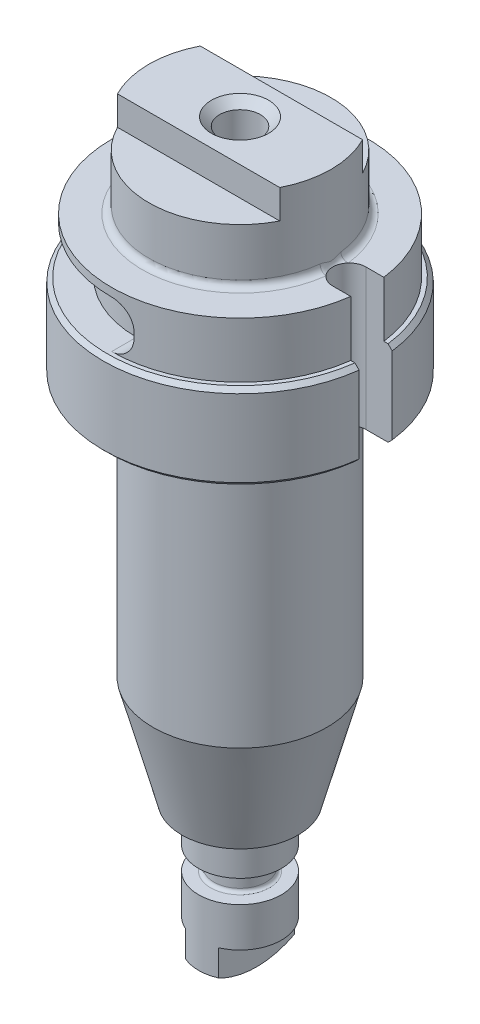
ISO-10303-21;
HEADER;
FILE_DESCRIPTION(('STEP AP214'),'2;1');
FILE_NAME('part.step','',(''),(''),'','','');
FILE_SCHEMA(('AUTOMOTIVE_DESIGN { 1 0 10303 214 1 1 1 1 }'));
ENDSEC;
DATA;
#1=APPLICATION_CONTEXT('core data for automotive mechanical design processes');
#2=APPLICATION_PROTOCOL_DEFINITION('international standard','automotive_design',2000,#1);
#3=PRODUCT_CONTEXT('',#1,'mechanical');
#4=PRODUCT('Part','Part','',(#3));
#5=PRODUCT_RELATED_PRODUCT_CATEGORY('part','',(#4));
#6=PRODUCT_DEFINITION_FORMATION('','',#4);
#7=PRODUCT_DEFINITION_CONTEXT('part definition',#1,'design');
#8=PRODUCT_DEFINITION('design','',#6,#7);
#9=PRODUCT_DEFINITION_SHAPE('','',#8);
#10=(LENGTH_UNIT() NAMED_UNIT(*) SI_UNIT(.MILLI.,.METRE.));
#11=(NAMED_UNIT(*) PLANE_ANGLE_UNIT() SI_UNIT($,.RADIAN.));
#12=(NAMED_UNIT(*) SI_UNIT($,.STERADIAN.) SOLID_ANGLE_UNIT());
#13=UNCERTAINTY_MEASURE_WITH_UNIT(LENGTH_MEASURE(1.E-05),#10,'distance_accuracy_value','');
#14=(GEOMETRIC_REPRESENTATION_CONTEXT(3) GLOBAL_UNCERTAINTY_ASSIGNED_CONTEXT((#13)) GLOBAL_UNIT_ASSIGNED_CONTEXT((#10,
#11,#12)) REPRESENTATION_CONTEXT('',''));
#15=CARTESIAN_POINT('',(0.,0.,0.));
#16=DIRECTION('',(0.,0.,1.));
#17=DIRECTION('',(1.,0.,0.));
#18=AXIS2_PLACEMENT_3D('',#15,#16,#17);
#19=CARTESIAN_POINT('',(0.,-27.3,0.));
#20=DIRECTION('',(0.,-1.,0.));
#21=DIRECTION('',(0.,0.,-1.));
#22=AXIS2_PLACEMENT_3D('',#19,#20,#21);
#23=TOROIDAL_SURFACE('',#22,11.3,0.8);
#24=CARTESIAN_POINT('',(1.50620913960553,-26.5,-11.1991666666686));
#25=CARTESIAN_POINT('',(1.46197874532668,-26.5000169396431,-11.1702039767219));
#26=CARTESIAN_POINT('',(1.41696832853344,-26.5022417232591,-11.1425680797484));
#27=CARTESIAN_POINT('',(1.32576519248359,-26.5101552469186,-11.0901042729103));
#28=CARTESIAN_POINT('',(1.27957552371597,-26.5158357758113,-11.0652698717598));
#29=CARTESIAN_POINT('',(1.18581271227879,-26.5297726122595,-11.0182414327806));
#30=CARTESIAN_POINT('',(1.1382315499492,-26.5380488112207,-10.9960696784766));
#31=CARTESIAN_POINT('',(1.04213228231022,-26.5563098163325,-10.9545725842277));
#32=CARTESIAN_POINT('',(0.993613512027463,-26.5662958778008,-10.9352493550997));
#33=CARTESIAN_POINT('',(0.876222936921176,-26.5913003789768,-10.89230975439));
#34=CARTESIAN_POINT('',(0.806943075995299,-26.606738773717,-10.8700497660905));
#35=CARTESIAN_POINT('',(0.666695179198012,-26.6370452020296,-10.8310456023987));
#36=CARTESIAN_POINT('',(0.595726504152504,-26.6519130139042,-10.8143035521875));
#37=CARTESIAN_POINT('',(0.452804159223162,-26.678473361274,-10.7865683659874));
#38=CARTESIAN_POINT('',(0.380867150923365,-26.6901958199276,-10.7755200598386));
#39=CARTESIAN_POINT('',(0.235704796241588,-26.7082237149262,-10.7591492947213));
#40=CARTESIAN_POINT('',(0.162481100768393,-26.7145356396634,-10.7538199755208));
#41=CARTESIAN_POINT('',(0.0193039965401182,-26.7200101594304,-10.74918370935));
#42=CARTESIAN_POINT('',(-0.0506256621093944,-26.719521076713,-10.7495833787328));
#43=CARTESIAN_POINT('',(-0.18995687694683,-26.7123614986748,-10.7556809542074));
#44=CARTESIAN_POINT('',(-0.259358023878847,-26.7056866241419,-10.7613826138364));
#45=CARTESIAN_POINT('',(-0.397569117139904,-26.6875759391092,-10.7779903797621));
#46=CARTESIAN_POINT('',(-0.466366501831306,-26.6760938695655,-10.7889472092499));
#47=CARTESIAN_POINT('',(-0.602419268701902,-26.6505040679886,-10.8158978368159));
#48=CARTESIAN_POINT('',(-0.66967460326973,-26.6363962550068,-10.8318917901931));
#49=CARTESIAN_POINT('',(-0.849913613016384,-26.5974618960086,-10.8819704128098));
#50=CARTESIAN_POINT('',(-0.961528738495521,-26.5721241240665,-10.9208432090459));
#51=CARTESIAN_POINT('',(-1.12504387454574,-26.5403684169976,-10.9899724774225));
#52=CARTESIAN_POINT('',(-1.17871548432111,-26.5308476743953,-11.0147130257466));
#53=CARTESIAN_POINT('',(-1.28471196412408,-26.5150525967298,-11.0678155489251));
#54=CARTESIAN_POINT('',(-1.33703822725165,-26.5087747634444,-11.096173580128));
#55=CARTESIAN_POINT('',(-1.408373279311,-26.5032522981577,-11.1379001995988));
#56=CARTESIAN_POINT('',(-1.42811408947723,-26.5020559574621,-11.1497826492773));
#57=CARTESIAN_POINT('',(-1.46735842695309,-26.5004292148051,-11.1740823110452));
#58=CARTESIAN_POINT('',(-1.4868613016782,-26.500000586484,-11.1865006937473));
#59=CARTESIAN_POINT('',(-1.50620913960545,-26.5,-11.1991666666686));
#60=B_SPLINE_CURVE_WITH_KNOTS('',3,(#24,#25,#26,#27,#28,#29,#30,#31,#32,#33,#34,#35,#36,#37,#38,
#39,#40,#41,#42,#43,#44,#45,#46,#47,#48,#49,#50,#51,#52,#53,#54,#55,#56,#57,#58,#59),
.UNSPECIFIED.,.F.,.F.,(4,2,2,2,2,2,2,2,2,2,2,2,2,2,2,2,2,4),(0.,0.15843471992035,
0.316494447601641,0.475796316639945,0.635215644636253,0.858143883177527,1.08115788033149,
1.30196828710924,1.52251352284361,1.7318067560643,1.94124827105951,2.15275330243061,
2.36426485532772,2.72566121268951,2.90510026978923,3.08434535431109,3.15354487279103,
3.22290405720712),.UNSPECIFIED.);
#61=CARTESIAN_POINT('',(1.50621674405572,-26.5,-11.1991716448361));
#62=VERTEX_POINT('',#61);
#63=CARTESIAN_POINT('',(-1.50623513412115,-26.5,-11.1991836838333));
#64=VERTEX_POINT('',#63);
#65=EDGE_CURVE('E223',#62,#64,#60,.T.);
#66=ORIENTED_EDGE('',*,*,#65,.F.);
#67=CARTESIAN_POINT('',(0.,-26.5,0.));
#68=DIRECTION('',(0.,-1.,0.));
#69=DIRECTION('',(0.133294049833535,0.,-0.991076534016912));
#70=AXIS2_PLACEMENT_3D('',#67,#68,#69);
#71=CIRCLE('',#70,11.3);
#72=CARTESIAN_POINT('',(11.2852272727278,-26.5,-0.577620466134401));
#73=VERTEX_POINT('',#72);
#74=EDGE_CURVE('E233',#73,#62,#71,.F.);
#75=ORIENTED_EDGE('',*,*,#74,.F.);
#76=CARTESIAN_POINT('',(11.2852272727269,-27.3,-0.577620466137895));
#77=DIRECTION('',(0.0511168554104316,-1.03487154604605E-12,0.998692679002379));
#78=DIRECTION('',(0.998692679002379,0.,-0.0511168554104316));
#79=AXIS2_PLACEMENT_3D('',#76,#77,#78);
#80=CIRCLE('',#79,0.799999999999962);
#81=CARTESIAN_POINT('',(10.4862731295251,-27.3,-0.536726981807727));
#82=VERTEX_POINT('',#81);
#83=EDGE_CURVE('E254',#73,#82,#80,.T.);
#84=ORIENTED_EDGE('',*,*,#83,.T.);
#85=CARTESIAN_POINT('',(0.,-27.3,0.));
#86=DIRECTION('',(0.,-1.,0.));
#87=DIRECTION('',(0.,0.,-1.));
#88=AXIS2_PLACEMENT_3D('',#85,#86,#87);
#89=CIRCLE('',#88,10.5);
#90=CARTESIAN_POINT('',(10.4862731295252,-27.3,0.536726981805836));
#91=VERTEX_POINT('',#90);
#92=EDGE_CURVE('E674',#91,#82,#89,.T.);
#93=ORIENTED_EDGE('',*,*,#92,.F.);
#94=CARTESIAN_POINT('',(11.2852272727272,-27.3,0.577620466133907));
#95=DIRECTION('',(0.0511168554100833,-4.79292115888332E-13,-0.998692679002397));
#96=DIRECTION('',(-0.998692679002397,0.,-0.0511168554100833));
#97=AXIS2_PLACEMENT_3D('',#94,#95,#96);
#98=CIRCLE('',#97,0.800000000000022);
#99=CARTESIAN_POINT('',(11.2852272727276,-26.5,0.577620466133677));
#100=VERTEX_POINT('',#99);
#101=EDGE_CURVE('E669',#91,#100,#98,.T.);
#102=ORIENTED_EDGE('',*,*,#101,.T.);
#103=CARTESIAN_POINT('',(0.,-26.5,0.));
#104=DIRECTION('',(0.,-1.,0.));
#105=DIRECTION('',(0.998692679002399,0.,0.0511168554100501));
#106=AXIS2_PLACEMENT_3D('',#103,#104,#105);
#107=CIRCLE('',#106,11.3);
#108=EDGE_CURVE('E237',#64,#100,#107,.F.);
#109=ORIENTED_EDGE('',*,*,#108,.F.);
#110=EDGE_LOOP('',(#66,#75,#84,#93,#102,#109));
#111=FACE_BOUND('',#110,.T.);
#112=ADVANCED_FACE('F18',(#111),#23,.F.);
#113=CARTESIAN_POINT('',(0.,-26.5,0.));
#114=DIRECTION('',(0.,-1.,0.));
#115=DIRECTION('',(0.,0.,-1.));
#116=AXIS2_PLACEMENT_3D('',#113,#114,#115);
#117=PLANE('',#116);
#118=CARTESIAN_POINT('',(0.,-26.5,-13.5));
#119=DIRECTION('',(0.,-1.,0.));
#120=DIRECTION('',(0.,0.,-1.));
#121=AXIS2_PLACEMENT_3D('',#118,#119,#120);
#122=CIRCLE('',#121,2.75);
#123=CARTESIAN_POINT('',(1.24627144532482,-26.5,-15.9513888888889));
#124=VERTEX_POINT('',#123);
#125=EDGE_CURVE('E227',#124,#62,#122,.T.);
#126=ORIENTED_EDGE('',*,*,#125,.F.);
#127=CARTESIAN_POINT('',(0.,-26.5,0.));
#128=DIRECTION('',(0.,1.,0.));
#129=DIRECTION('',(0.,0.,1.));
#130=AXIS2_PLACEMENT_3D('',#127,#128,#129);
#131=CIRCLE('',#130,16.);
#132=CARTESIAN_POINT('',(15.8745078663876,-26.5,-2.00000000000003));
#133=VERTEX_POINT('',#132);
#134=EDGE_CURVE('E593',#124,#133,#131,.F.);
#135=ORIENTED_EDGE('',*,*,#134,.T.);
#136=DIRECTION('',(1.,0.,0.));
#137=VECTOR('',#136,1.);
#138=CARTESIAN_POINT('',(0.,-26.5,-2.00000000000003));
#139=LINE('',#138,#137);
#140=CARTESIAN_POINT('',(13.2,-26.5,-2.00000000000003));
#141=VERTEX_POINT('',#140);
#142=EDGE_CURVE('E265',#133,#141,#139,.F.);
#143=ORIENTED_EDGE('',*,*,#142,.T.);
#144=CARTESIAN_POINT('',(13.2,-26.5,0.));
#145=DIRECTION('',(0.,1.,0.));
#146=DIRECTION('',(0.,0.,1.));
#147=AXIS2_PLACEMENT_3D('',#144,#145,#146);
#148=CIRCLE('',#147,2.00000000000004);
#149=EDGE_CURVE('E253',#141,#73,#148,.T.);
#150=ORIENTED_EDGE('',*,*,#149,.T.);
#151=ORIENTED_EDGE('',*,*,#74,.T.);
#152=EDGE_LOOP('',(#126,#135,#143,#150,#151));
#153=FACE_BOUND('',#152,.T.);
#154=ADVANCED_FACE('F250',(#153),#117,.T.);
#155=CARTESIAN_POINT('',(-3.64212447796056,-83.,0.));
#156=DIRECTION('',(0.,-1.,0.));
#157=DIRECTION('',(0.,0.,-1.));
#158=AXIS2_PLACEMENT_3D('',#155,#156,#157);
#159=PLANE('',#158);
#160=DIRECTION('',(0.,0.,1.));
#161=VECTOR('',#160,1.);
#162=CARTESIAN_POINT('',(-2.,-83.,0.));
#163=LINE('',#162,#161);
#164=CARTESIAN_POINT('',(-2.,-83.,4.58257569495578));
#165=VERTEX_POINT('',#164);
#166=CARTESIAN_POINT('',(-2.,-83.,-4.58257569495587));
#167=VERTEX_POINT('',#166);
#168=EDGE_CURVE('E600',#165,#167,#163,.F.);
#169=ORIENTED_EDGE('',*,*,#168,.F.);
#170=CARTESIAN_POINT('',(0.,-83.,0.));
#171=DIRECTION('',(0.,1.,0.));
#172=DIRECTION('',(0.,0.,1.));
#173=AXIS2_PLACEMENT_3D('',#170,#171,#172);
#174=CIRCLE('',#173,5.);
#175=EDGE_CURVE('E484',#167,#165,#174,.T.);
#176=ORIENTED_EDGE('',*,*,#175,.F.);
#177=EDGE_LOOP('',(#169,#176));
#178=FACE_BOUND('',#177,.T.);
#179=ADVANCED_FACE('F512',(#178),#159,.T.);
#180=CARTESIAN_POINT('',(-2.,-85.1974305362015,0.));
#181=DIRECTION('',(-1.,0.,0.));
#182=DIRECTION('',(0.,0.,1.));
#183=AXIS2_PLACEMENT_3D('',#180,#181,#182);
#184=PLANE('',#183);
#185=DIRECTION('',(0.,1.,0.));
#186=VECTOR('',#185,1.);
#187=CARTESIAN_POINT('',(-2.00000000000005,-84.5782032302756,-4.58257569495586));
#188=LINE('',#187,#186);
#189=CARTESIAN_POINT('',(-2.00000000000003,-86.1602540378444,-4.58257569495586));
#190=VERTEX_POINT('',#189);
#191=EDGE_CURVE('E487',#190,#167,#188,.T.);
#192=ORIENTED_EDGE('',*,*,#191,.F.);
#193=CARTESIAN_POINT('',(-2.,-86.1602540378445,4.58257569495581));
#194=CARTESIAN_POINT('',(-2.,-86.2892009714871,4.33895234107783));
#195=CARTESIAN_POINT('',(-2.,-86.407813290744,4.0898651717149));
#196=CARTESIAN_POINT('',(-2.,-86.6236398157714,3.58259850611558));
#197=CARTESIAN_POINT('',(-2.,-86.7208549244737,3.32441939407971));
#198=CARTESIAN_POINT('',(-2.,-86.8930623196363,2.80110791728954));
#199=CARTESIAN_POINT('',(-2.,-86.9680820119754,2.53598457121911));
#200=CARTESIAN_POINT('',(-2.,-87.0955350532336,2.0003690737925));
#201=CARTESIAN_POINT('',(-2.,-87.1479688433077,1.72987702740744));
#202=CARTESIAN_POINT('',(-2.,-87.2299098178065,1.18522479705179));
#203=CARTESIAN_POINT('',(-2.,-87.2593989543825,0.911061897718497));
#204=CARTESIAN_POINT('',(-2.,-87.2951729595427,0.361226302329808));
#205=CARTESIAN_POINT('',(-2.,-87.3014578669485,0.0855536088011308));
#206=CARTESIAN_POINT('',(-2.,-87.2907806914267,-0.465274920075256));
#207=CARTESIAN_POINT('',(-2.,-87.2738240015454,-0.740430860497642));
#208=CARTESIAN_POINT('',(-2.,-87.2167934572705,-1.28832025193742));
#209=CARTESIAN_POINT('',(-2.,-87.176721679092,-1.5610539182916));
#210=CARTESIAN_POINT('',(-2.,-87.0796653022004,-2.07110190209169));
#211=CARTESIAN_POINT('',(-2.,-87.0251489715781,-2.30888948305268));
#212=CARTESIAN_POINT('',(-2.,-86.8985402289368,-2.77972398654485));
#213=CARTESIAN_POINT('',(-2.,-86.8264493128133,-3.01277131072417));
#214=CARTESIAN_POINT('',(-2.,-86.6650434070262,-3.47295894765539));
#215=CARTESIAN_POINT('',(-2.,-86.5757193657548,-3.70009608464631));
#216=CARTESIAN_POINT('',(-2.,-86.3803776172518,-4.14710603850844));
#217=CARTESIAN_POINT('',(-2.,-86.2743579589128,-4.36697800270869));
#218=CARTESIAN_POINT('',(-2.,-86.1602540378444,-4.58257569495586));
#219=B_SPLINE_CURVE_WITH_KNOTS('',3,(#193,#194,#195,#196,#197,#198,#199,#200,#201,#202,#203,
#204,#205,#206,#207,#208,#209,#210,#211,#212,#213,#214,#215,#216,#217,#218),.UNSPECIFIED.,.F.,
.F.,(4,2,2,2,2,2,2,2,2,2,2,2,4),(0.,0.826679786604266,1.65332468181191,2.47894457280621,
3.30454833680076,4.13080085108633,4.95705198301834,5.78311142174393,6.60909667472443,
7.34030409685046,8.07144930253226,8.80297958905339,9.53459542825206),.UNSPECIFIED.);
#220=CARTESIAN_POINT('',(-2.,-86.1602540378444,4.5825756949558));
#221=VERTEX_POINT('',#220);
#222=EDGE_CURVE('E488',#221,#190,#219,.T.);
#223=ORIENTED_EDGE('',*,*,#222,.F.);
#224=DIRECTION('',(0.,1.,0.));
#225=VECTOR('',#224,1.);
#226=CARTESIAN_POINT('',(-1.99999999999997,-84.5782032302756,4.58257569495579));
#227=LINE('',#226,#225);
#228=EDGE_CURVE('E483',#165,#221,#227,.F.);
#229=ORIENTED_EDGE('',*,*,#228,.F.);
#230=ORIENTED_EDGE('',*,*,#168,.T.);
#231=EDGE_LOOP('',(#192,#223,#229,#230));
#232=FACE_BOUND('',#231,.T.);
#233=ADVANCED_FACE('F506',(#232),#184,.T.);
#234=CARTESIAN_POINT('',(3.64212447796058,-83.,0.));
#235=DIRECTION('',(0.,-1.,0.));
#236=DIRECTION('',(0.,0.,-1.));
#237=AXIS2_PLACEMENT_3D('',#234,#235,#236);
#238=PLANE('',#237);
#239=DIRECTION('',(0.,0.,-1.));
#240=VECTOR('',#239,1.);
#241=CARTESIAN_POINT('',(2.,-83.,0.));
#242=LINE('',#241,#240);
#243=CARTESIAN_POINT('',(2.,-83.,-4.58257569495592));
#244=VERTEX_POINT('',#243);
#245=CARTESIAN_POINT('',(2.,-83.,4.58257569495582));
#246=VERTEX_POINT('',#245);
#247=EDGE_CURVE('E843',#244,#246,#242,.F.);
#248=ORIENTED_EDGE('',*,*,#247,.F.);
#249=CARTESIAN_POINT('',(0.,-83.,0.));
#250=DIRECTION('',(0.,1.,0.));
#251=DIRECTION('',(0.,0.,1.));
#252=AXIS2_PLACEMENT_3D('',#249,#250,#251);
#253=CIRCLE('',#252,5.);
#254=EDGE_CURVE('E476',#246,#244,#253,.T.);
#255=ORIENTED_EDGE('',*,*,#254,.F.);
#256=EDGE_LOOP('',(#248,#255));
#257=FACE_BOUND('',#256,.T.);
#258=ADVANCED_FACE('F511',(#257),#238,.T.);
#259=CARTESIAN_POINT('',(2.,-85.1974305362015,0.));
#260=DIRECTION('',(1.,0.,0.));
#261=DIRECTION('',(0.,0.,-1.));
#262=AXIS2_PLACEMENT_3D('',#259,#260,#261);
#263=PLANE('',#262);
#264=DIRECTION('',(0.,1.,0.));
#265=VECTOR('',#264,1.);
#266=CARTESIAN_POINT('',(2.,-84.5782032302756,-4.58257569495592));
#267=LINE('',#266,#265);
#268=CARTESIAN_POINT('',(2.,-86.1602540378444,-4.5825756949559));
#269=VERTEX_POINT('',#268);
#270=EDGE_CURVE('E475',#244,#269,#267,.F.);
#271=ORIENTED_EDGE('',*,*,#270,.F.);
#272=ORIENTED_EDGE('',*,*,#247,.T.);
#273=DIRECTION('',(0.,1.,0.));
#274=VECTOR('',#273,1.);
#275=CARTESIAN_POINT('',(2.,-84.5782032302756,4.58257569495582));
#276=LINE('',#275,#274);
#277=CARTESIAN_POINT('',(2.,-86.1602540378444,4.58257569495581));
#278=VERTEX_POINT('',#277);
#279=EDGE_CURVE('E479',#278,#246,#276,.T.);
#280=ORIENTED_EDGE('',*,*,#279,.F.);
#281=CARTESIAN_POINT('',(2.,-86.1602540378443,-4.58257569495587));
#282=CARTESIAN_POINT('',(2.,-86.2892009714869,-4.33895234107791));
#283=CARTESIAN_POINT('',(2.,-86.4078132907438,-4.08986517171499));
#284=CARTESIAN_POINT('',(2.,-86.6236398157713,-3.58259850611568));
#285=CARTESIAN_POINT('',(2.,-86.7208549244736,-3.32441939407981));
#286=CARTESIAN_POINT('',(2.,-86.8930623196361,-2.80110791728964));
#287=CARTESIAN_POINT('',(2.,-86.9680820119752,-2.53598457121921));
#288=CARTESIAN_POINT('',(2.,-87.0955350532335,-2.0003690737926));
#289=CARTESIAN_POINT('',(2.,-87.1479688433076,-1.72987702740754));
#290=CARTESIAN_POINT('',(2.,-87.2299098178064,-1.18522479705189));
#291=CARTESIAN_POINT('',(2.,-87.2593989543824,-0.911061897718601));
#292=CARTESIAN_POINT('',(2.,-87.2951729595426,-0.361226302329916));
#293=CARTESIAN_POINT('',(2.,-87.3014578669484,-0.0855536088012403));
#294=CARTESIAN_POINT('',(2.,-87.2907806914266,0.465274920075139));
#295=CARTESIAN_POINT('',(2.,-87.2738240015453,0.74043086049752));
#296=CARTESIAN_POINT('',(2.,-87.2167934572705,1.2883202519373));
#297=CARTESIAN_POINT('',(2.,-87.176721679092,1.56105391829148));
#298=CARTESIAN_POINT('',(2.,-87.0796653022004,2.07110190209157));
#299=CARTESIAN_POINT('',(2.,-87.025148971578,2.30888948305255));
#300=CARTESIAN_POINT('',(2.,-86.8985402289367,2.77972398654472));
#301=CARTESIAN_POINT('',(2.,-86.8264493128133,3.01277131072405));
#302=CARTESIAN_POINT('',(2.,-86.6650434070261,3.4729589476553));
#303=CARTESIAN_POINT('',(2.,-86.5757193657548,3.70009608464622));
#304=CARTESIAN_POINT('',(2.,-86.3803776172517,4.14710603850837));
#305=CARTESIAN_POINT('',(2.,-86.2743579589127,4.36697800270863));
#306=CARTESIAN_POINT('',(2.,-86.1602540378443,4.5825756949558));
#307=B_SPLINE_CURVE_WITH_KNOTS('',3,(#281,#282,#283,#284,#285,#286,#287,#288,#289,#290,#291,
#292,#293,#294,#295,#296,#297,#298,#299,#300,#301,#302,#303,#304,#305,#306),.UNSPECIFIED.,.F.,
.F.,(4,2,2,2,2,2,2,2,2,2,2,2,4),(0.,0.826679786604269,1.65332468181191,2.47894457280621,
3.30454833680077,4.13080085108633,4.95705198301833,5.78311142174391,6.6090966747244,
7.34030409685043,8.07144930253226,8.80297958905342,9.53459542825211),.UNSPECIFIED.);
#308=EDGE_CURVE('E496',#269,#278,#307,.T.);
#309=ORIENTED_EDGE('',*,*,#308,.F.);
#310=EDGE_LOOP('',(#271,#272,#280,#309));
#311=FACE_BOUND('',#310,.T.);
#312=ADVANCED_FACE('F858',(#311),#263,.T.);
#313=CARTESIAN_POINT('',(-2.22044604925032E-13,-77.5,0.));
#314=DIRECTION('',(0.,0.,-1.));
#315=DIRECTION('',(0.,1.,0.));
#316=AXIS2_PLACEMENT_3D('',#313,#314,#315);
#317=SPHERICAL_SURFACE('',#316,10.);
#318=ORIENTED_EDGE('',*,*,#222,.T.);
#319=CARTESIAN_POINT('',(0.,-86.1602540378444,0.));
#320=DIRECTION('',(0.,1.,0.));
#321=DIRECTION('',(0.,0.,1.));
#322=AXIS2_PLACEMENT_3D('',#319,#320,#321);
#323=CIRCLE('',#322,5.);
#324=EDGE_CURVE('E472',#269,#190,#323,.T.);
#325=ORIENTED_EDGE('',*,*,#324,.F.);
#326=ORIENTED_EDGE('',*,*,#308,.T.);
#327=CARTESIAN_POINT('',(0.,-86.1602540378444,0.));
#328=DIRECTION('',(0.,1.,0.));
#329=DIRECTION('',(0.,0.,1.));
#330=AXIS2_PLACEMENT_3D('',#327,#328,#329);
#331=CIRCLE('',#330,5.);
#332=EDGE_CURVE('E480',#221,#278,#331,.T.);
#333=ORIENTED_EDGE('',*,*,#332,.F.);
#334=EDGE_LOOP('',(#318,#325,#326,#333));
#335=FACE_BOUND('',#334,.T.);
#336=ADVANCED_FACE('F502',(#335),#317,.T.);
#337=CARTESIAN_POINT('',(0.,-84.5782032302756,0.));
#338=DIRECTION('',(0.,1.,0.));
#339=DIRECTION('',(0.,0.,1.));
#340=AXIS2_PLACEMENT_3D('',#337,#338,#339);
#341=CYLINDRICAL_SURFACE('',#340,5.);
#342=ORIENTED_EDGE('',*,*,#270,.T.);
#343=ORIENTED_EDGE('',*,*,#324,.T.);
#344=ORIENTED_EDGE('',*,*,#191,.T.);
#345=ORIENTED_EDGE('',*,*,#175,.T.);
#346=ORIENTED_EDGE('',*,*,#228,.T.);
#347=ORIENTED_EDGE('',*,*,#332,.T.);
#348=ORIENTED_EDGE('',*,*,#279,.T.);
#349=ORIENTED_EDGE('',*,*,#254,.T.);
#350=EDGE_LOOP('',(#342,#343,#344,#345,#346,#347,#348,#349));
#351=FACE_BOUND('',#350,.T.);
#352=CARTESIAN_POINT('',(0.,-78.25,0.));
#353=DIRECTION('',(0.,1.,0.));
#354=DIRECTION('',(0.,0.,1.));
#355=AXIS2_PLACEMENT_3D('',#352,#353,#354);
#356=CIRCLE('',#355,5.);
#357=CARTESIAN_POINT('',(0.,-78.25,4.99999999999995));
#358=VERTEX_POINT('',#357);
#359=EDGE_CURVE('E465',#358,#358,#356,.T.);
#360=ORIENTED_EDGE('',*,*,#359,.F.);
#361=EDGE_LOOP('',(#360));
#362=FACE_BOUND('',#361,.T.);
#363=ADVANCED_FACE('F849',(#351,#362),#341,.T.);
#364=CARTESIAN_POINT('',(0.,-78.25,0.));
#365=DIRECTION('',(0.,1.,0.));
#366=DIRECTION('',(0.,0.,1.));
#367=AXIS2_PLACEMENT_3D('',#364,#365,#366);
#368=PLANE('',#367);
#369=ORIENTED_EDGE('',*,*,#359,.T.);
#370=EDGE_LOOP('',(#369));
#371=FACE_BOUND('',#370,.T.);
#372=CARTESIAN_POINT('',(-1.05623255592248E-13,-78.2500000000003,-2.26482409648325E-13));
#373=DIRECTION('',(0.,1.,0.));
#374=DIRECTION('',(0.,0.,1.));
#375=AXIS2_PLACEMENT_3D('',#372,#373,#374);
#376=CIRCLE('',#375,3.5499999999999);
#377=CARTESIAN_POINT('',(-1.05623255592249E-13,-78.2500000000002,3.54999999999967));
#378=VERTEX_POINT('',#377);
#379=EDGE_CURVE('E468',#378,#378,#376,.F.);
#380=ORIENTED_EDGE('',*,*,#379,.T.);
#381=EDGE_LOOP('',(#380));
#382=FACE_BOUND('',#381,.T.);
#383=ADVANCED_FACE('F821',(#371,#382),#368,.T.);
#384=CARTESIAN_POINT('',(-1.11022302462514E-13,-77.8500000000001,-2.40692882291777E-13));
#385=DIRECTION('',(0.,1.,0.));
#386=DIRECTION('',(0.,0.,1.));
#387=AXIS2_PLACEMENT_3D('',#384,#385,#386);
#388=TOROIDAL_SURFACE('',#387,3.54999999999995,0.400000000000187);
#389=ORIENTED_EDGE('',*,*,#379,.F.);
#390=EDGE_LOOP('',(#389));
#391=FACE_BOUND('',#390,.T.);
#392=CARTESIAN_POINT('',(0.,-77.85,0.));
#393=DIRECTION('',(0.,-1.,0.));
#394=DIRECTION('',(0.,0.,-1.));
#395=AXIS2_PLACEMENT_3D('',#392,#393,#394);
#396=CIRCLE('',#395,3.15);
#397=CARTESIAN_POINT('',(0.,-77.85,-3.15000000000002));
#398=VERTEX_POINT('',#397);
#399=EDGE_CURVE('E794',#398,#398,#396,.F.);
#400=ORIENTED_EDGE('',*,*,#399,.F.);
#401=EDGE_LOOP('',(#400));
#402=FACE_BOUND('',#401,.T.);
#403=ADVANCED_FACE('F815',(#391,#402),#388,.F.);
#404=CARTESIAN_POINT('',(0.,-76.29,0.));
#405=DIRECTION('',(0.,-1.,0.));
#406=DIRECTION('',(0.,0.,-1.));
#407=AXIS2_PLACEMENT_3D('',#404,#405,#406);
#408=CYLINDRICAL_SURFACE('',#407,3.15);
#409=ORIENTED_EDGE('',*,*,#399,.T.);
#410=EDGE_LOOP('',(#409));
#411=FACE_BOUND('',#410,.T.);
#412=CARTESIAN_POINT('',(0.,-75.9,0.));
#413=DIRECTION('',(0.,1.,0.));
#414=DIRECTION('',(-1.,0.,0.));
#415=AXIS2_PLACEMENT_3D('',#412,#413,#414);
#416=CIRCLE('',#415,3.15);
#417=CARTESIAN_POINT('',(-3.15000000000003,-75.9,0.));
#418=VERTEX_POINT('',#417);
#419=EDGE_CURVE('E459',#418,#418,#416,.F.);
#420=ORIENTED_EDGE('',*,*,#419,.T.);
#421=EDGE_LOOP('',(#420));
#422=FACE_BOUND('',#421,.T.);
#423=ADVANCED_FACE('F820',(#411,#422),#408,.T.);
#424=CARTESIAN_POINT('',(0.,-75.8999999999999,0.));
#425=DIRECTION('',(0.,1.,0.));
#426=DIRECTION('',(-1.,0.,0.));
#427=AXIS2_PLACEMENT_3D('',#424,#425,#426);
#428=TOROIDAL_SURFACE('',#427,3.54999999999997,0.4);
#429=CARTESIAN_POINT('',(0.,-75.5,0.));
#430=DIRECTION('',(0.,-1.,0.));
#431=DIRECTION('',(-1.,0.,0.));
#432=AXIS2_PLACEMENT_3D('',#429,#430,#431);
#433=CIRCLE('',#432,3.54999999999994);
#434=CARTESIAN_POINT('',(-3.54999999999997,-75.5,0.));
#435=VERTEX_POINT('',#434);
#436=EDGE_CURVE('E338',#435,#435,#433,.F.);
#437=ORIENTED_EDGE('',*,*,#436,.F.);
#438=EDGE_LOOP('',(#437));
#439=FACE_BOUND('',#438,.T.);
#440=ORIENTED_EDGE('',*,*,#419,.F.);
#441=EDGE_LOOP('',(#440));
#442=FACE_BOUND('',#441,.T.);
#443=ADVANCED_FACE('F354',(#439,#442),#428,.F.);
#444=CARTESIAN_POINT('',(0.,-75.5,0.));
#445=DIRECTION('',(0.,-1.,0.));
#446=DIRECTION('',(0.,0.,-1.));
#447=AXIS2_PLACEMENT_3D('',#444,#445,#446);
#448=PLANE('',#447);
#449=CARTESIAN_POINT('',(0.,-75.5,0.));
#450=DIRECTION('',(0.,1.,0.));
#451=DIRECTION('',(0.,0.,1.));
#452=AXIS2_PLACEMENT_3D('',#449,#450,#451);
#453=CIRCLE('',#452,5.);
#454=CARTESIAN_POINT('',(0.,-75.5,4.99999999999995));
#455=VERTEX_POINT('',#454);
#456=EDGE_CURVE('E322',#455,#455,#453,.T.);
#457=ORIENTED_EDGE('',*,*,#456,.F.);
#458=EDGE_LOOP('',(#457));
#459=FACE_BOUND('',#458,.T.);
#460=ORIENTED_EDGE('',*,*,#436,.T.);
#461=EDGE_LOOP('',(#460));
#462=FACE_BOUND('',#461,.T.);
#463=ADVANCED_FACE('F344',(#459,#462),#448,.T.);
#464=CARTESIAN_POINT('',(0.,-74.68,0.));
#465=DIRECTION('',(0.,1.,0.));
#466=DIRECTION('',(0.,0.,1.));
#467=AXIS2_PLACEMENT_3D('',#464,#465,#466);
#468=CYLINDRICAL_SURFACE('',#467,5.);
#469=CARTESIAN_POINT('',(-1.11022302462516E-13,-71.4,1.88651178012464E-13));
#470=DIRECTION('',(0.,-1.,0.));
#471=DIRECTION('',(0.,0.,-1.));
#472=AXIS2_PLACEMENT_3D('',#469,#470,#471);
#473=CIRCLE('',#472,4.99999999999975);
#474=CARTESIAN_POINT('',(-1.11022302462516E-13,-71.4000000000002,-4.99999999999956));
#475=VERTEX_POINT('',#474);
#476=EDGE_CURVE('E298',#475,#475,#473,.T.);
#477=ORIENTED_EDGE('',*,*,#476,.T.);
#478=EDGE_LOOP('',(#477));
#479=FACE_BOUND('',#478,.T.);
#480=ORIENTED_EDGE('',*,*,#456,.T.);
#481=EDGE_LOOP('',(#480));
#482=FACE_BOUND('',#481,.T.);
#483=ADVANCED_FACE('F288',(#479,#482),#468,.T.);
#484=CARTESIAN_POINT('',(-1.11022302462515E-13,-71.3999999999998,1.88651178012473E-13));
#485=DIRECTION('',(0.,-1.,0.));
#486=DIRECTION('',(0.,0.,-1.));
#487=AXIS2_PLACEMENT_3D('',#484,#485,#486);
#488=TOROIDAL_SURFACE('',#487,5.39999999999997,0.400000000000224);
#489=ORIENTED_EDGE('',*,*,#476,.F.);
#490=EDGE_LOOP('',(#489));
#491=FACE_BOUND('',#490,.T.);
#492=CARTESIAN_POINT('',(-1.08899215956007E-13,-70.9999999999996,1.76354880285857E-13));
#493=DIRECTION('',(0.,-1.,0.));
#494=DIRECTION('',(0.,0.,-1.));
#495=AXIS2_PLACEMENT_3D('',#492,#493,#494);
#496=CIRCLE('',#495,5.3999999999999);
#497=CARTESIAN_POINT('',(-1.08899215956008E-13,-70.9999999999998,-5.39999999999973));
#498=VERTEX_POINT('',#497);
#499=EDGE_CURVE('E307',#498,#498,#496,.F.);
#500=ORIENTED_EDGE('',*,*,#499,.F.);
#501=EDGE_LOOP('',(#500));
#502=FACE_BOUND('',#501,.T.);
#503=ADVANCED_FACE('F283',(#491,#502),#488,.F.);
#504=CARTESIAN_POINT('',(0.,-71.,0.));
#505=DIRECTION('',(0.,-1.,0.));
#506=DIRECTION('',(0.,0.,-1.));
#507=AXIS2_PLACEMENT_3D('',#504,#505,#506);
#508=PLANE('',#507);
#509=CARTESIAN_POINT('',(0.,-71.,0.));
#510=DIRECTION('',(0.,1.,0.));
#511=DIRECTION('',(0.,0.,1.));
#512=AXIS2_PLACEMENT_3D('',#509,#510,#511);
#513=CIRCLE('',#512,7.01666049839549);
#514=CARTESIAN_POINT('',(0.,-71.,7.01666049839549));
#515=VERTEX_POINT('',#514);
#516=EDGE_CURVE('E620',#515,#515,#513,.T.);
#517=ORIENTED_EDGE('',*,*,#516,.F.);
#518=EDGE_LOOP('',(#517));
#519=FACE_BOUND('',#518,.T.);
#520=ORIENTED_EDGE('',*,*,#499,.T.);
#521=EDGE_LOOP('',(#520));
#522=FACE_BOUND('',#521,.T.);
#523=ADVANCED_FACE('F280',(#519,#522),#508,.T.);
#524=CARTESIAN_POINT('',(0.,-71.,0.));
#525=DIRECTION('',(0.,1.,0.));
#526=DIRECTION('',(0.,0.,1.));
#527=AXIS2_PLACEMENT_3D('',#524,#525,#526);
#528=CONICAL_SURFACE('',#527,7.01666049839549,0.261799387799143);
#529=CARTESIAN_POINT('',(0.,-58.,0.));
#530=DIRECTION('',(0.,1.,0.));
#531=DIRECTION('',(0.,0.,1.));
#532=AXIS2_PLACEMENT_3D('',#529,#530,#531);
#533=CIRCLE('',#532,10.5);
#534=CARTESIAN_POINT('',(0.,-58.,10.5));
#535=VERTEX_POINT('',#534);
#536=EDGE_CURVE('E616',#535,#535,#533,.T.);
#537=ORIENTED_EDGE('',*,*,#536,.F.);
#538=EDGE_LOOP('',(#537));
#539=FACE_BOUND('',#538,.T.);
#540=ORIENTED_EDGE('',*,*,#516,.T.);
#541=EDGE_LOOP('',(#540));
#542=FACE_BOUND('',#541,.T.);
#543=ADVANCED_FACE('F517',(#539,#542),#528,.T.);
#544=CARTESIAN_POINT('',(0.,-18.,0.));
#545=DIRECTION('',(0.,-1.,0.));
#546=DIRECTION('',(0.,0.,-1.));
#547=AXIS2_PLACEMENT_3D('',#544,#545,#546);
#548=PLANE('',#547);
#549=CARTESIAN_POINT('',(0.,-18.,0.));
#550=DIRECTION('',(0.,1.,0.));
#551=DIRECTION('',(0.,0.,1.));
#552=AXIS2_PLACEMENT_3D('',#549,#550,#551);
#553=CIRCLE('',#552,2.45999999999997);
#554=CARTESIAN_POINT('',(0.,-18.,2.45999999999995));
#555=VERTEX_POINT('',#554);
#556=EDGE_CURVE('E469',#555,#555,#553,.T.);
#557=ORIENTED_EDGE('',*,*,#556,.T.);
#558=EDGE_LOOP('',(#557));
#559=FACE_BOUND('',#558,.T.);
#560=ADVANCED_FACE('F647',(#559),#548,.F.);
#561=CARTESIAN_POINT('',(0.,-4.632,0.));
#562=DIRECTION('',(0.,1.,0.));
#563=DIRECTION('',(0.,0.,1.));
#564=AXIS2_PLACEMENT_3D('',#561,#562,#563);
#565=CYLINDRICAL_SURFACE('',#564,2.45999999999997);
#566=CARTESIAN_POINT('',(0.,-0.400000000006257,0.));
#567=DIRECTION('',(0.,1.,0.));
#568=DIRECTION('',(0.,0.,1.));
#569=AXIS2_PLACEMENT_3D('',#566,#567,#568);
#570=CIRCLE('',#569,2.45999999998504);
#571=CARTESIAN_POINT('',(0.,-0.400000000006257,2.45999999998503));
#572=VERTEX_POINT('',#571);
#573=EDGE_CURVE('E803',#572,#572,#570,.T.);
#574=ORIENTED_EDGE('',*,*,#573,.T.);
#575=EDGE_LOOP('',(#574));
#576=FACE_BOUND('',#575,.T.);
#577=ORIENTED_EDGE('',*,*,#556,.F.);
#578=EDGE_LOOP('',(#577));
#579=FACE_BOUND('',#578,.T.);
#580=ADVANCED_FACE('F825',(#576,#579),#565,.F.);
#581=CARTESIAN_POINT('',(0.,0.599999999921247,0.));
#582=DIRECTION('',(0.,1.,0.));
#583=DIRECTION('',(0.,0.,1.));
#584=AXIS2_PLACEMENT_3D('',#581,#582,#583);
#585=CONICAL_SURFACE('',#584,3.45999999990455,0.785398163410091);
#586=ORIENTED_EDGE('',*,*,#573,.F.);
#587=EDGE_LOOP('',(#586));
#588=FACE_BOUND('',#587,.T.);
#589=CARTESIAN_POINT('',(0.,0.59999999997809,0.));
#590=DIRECTION('',(0.,1.,0.));
#591=DIRECTION('',(0.,0.,1.));
#592=AXIS2_PLACEMENT_3D('',#589,#590,#591);
#593=CIRCLE('',#592,3.4599999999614);
#594=CARTESIAN_POINT('',(0.,0.59999999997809,3.45999999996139));
#595=VERTEX_POINT('',#594);
#596=EDGE_CURVE('E460',#595,#595,#593,.F.);
#597=ORIENTED_EDGE('',*,*,#596,.F.);
#598=EDGE_LOOP('',(#597));
#599=FACE_BOUND('',#598,.T.);
#600=ADVANCED_FACE('F823',(#588,#599),#585,.F.);
#601=CARTESIAN_POINT('',(-12.3316551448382,-13.,-2.46995228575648));
#602=DIRECTION('',(-0.996194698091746,0.,-0.0871557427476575));
#603=DIRECTION('',(-0.0871557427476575,0.,0.996194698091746));
#604=AXIS2_PLACEMENT_3D('',#601,#602,#603);
#605=PLANE('',#604);
#606=DIRECTION('',(0.,1.,0.));
#607=VECTOR('',#606,1.);
#608=CARTESIAN_POINT('',(-12.4524337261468,-14.5,-1.08944678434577));
#609=LINE('',#608,#607);
#610=CARTESIAN_POINT('',(-12.4524337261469,-10.5,-1.08944678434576));
#611=VERTEX_POINT('',#610);
#612=CARTESIAN_POINT('',(-12.4524337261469,-16.2,-1.08944678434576));
#613=VERTEX_POINT('',#612);
#614=EDGE_CURVE('E766',#611,#613,#609,.F.);
#615=ORIENTED_EDGE('',*,*,#614,.F.);
#616=CARTESIAN_POINT('',(-12.4524337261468,-13.,-1.08944678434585));
#617=DIRECTION('',(-0.996194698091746,0.,-0.0871557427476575));
#618=DIRECTION('',(-0.0871557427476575,0.,0.996194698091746));
#619=AXIS2_PLACEMENT_3D('',#616,#617,#618);
#620=CIRCLE('',#619,2.5);
#621=CARTESIAN_POINT('',(-12.2345443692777,-13.,-3.57993352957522));
#622=VERTEX_POINT('',#621);
#623=EDGE_CURVE('E742',#611,#622,#620,.T.);
#624=ORIENTED_EDGE('',*,*,#623,.T.);
#625=DIRECTION('',(0.,1.,0.));
#626=VECTOR('',#625,1.);
#627=CARTESIAN_POINT('',(-12.2345443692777,-16.2,-3.57993352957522));
#628=LINE('',#627,#626);
#629=CARTESIAN_POINT('',(-12.2345443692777,-13.7,-3.57993352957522));
#630=VERTEX_POINT('',#629);
#631=EDGE_CURVE('E752',#630,#622,#628,.T.);
#632=ORIENTED_EDGE('',*,*,#631,.F.);
#633=CARTESIAN_POINT('',(-12.4524337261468,-13.7,-1.08944678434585));
#634=DIRECTION('',(-0.996194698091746,0.,-0.0871557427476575));
#635=DIRECTION('',(-0.0871557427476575,0.,0.996194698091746));
#636=AXIS2_PLACEMENT_3D('',#633,#634,#635);
#637=CIRCLE('',#636,2.5);
#638=EDGE_CURVE('E740',#630,#613,#637,.T.);
#639=ORIENTED_EDGE('',*,*,#638,.T.);
#640=EDGE_LOOP('',(#615,#624,#632,#639));
#641=FACE_BOUND('',#640,.T.);
#642=ADVANCED_FACE('F767',(#641),#605,.T.);
#643=CARTESIAN_POINT('',(1.38577880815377,-13.,12.5));
#644=DIRECTION('',(0.,0.,1.));
#645=DIRECTION('',(1.,0.,0.));
#646=AXIS2_PLACEMENT_3D('',#643,#644,#645);
#647=PLANE('',#646);
#648=DIRECTION('',(0.,1.,0.));
#649=VECTOR('',#648,1.);
#650=CARTESIAN_POINT('',(2.50000000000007,-16.2,12.5));
#651=LINE('',#650,#649);
#652=CARTESIAN_POINT('',(2.50000000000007,-13.7,12.5));
#653=VERTEX_POINT('',#652);
#654=CARTESIAN_POINT('',(2.50000000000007,-13.,12.5));
#655=VERTEX_POINT('',#654);
#656=EDGE_CURVE('E965',#653,#655,#651,.T.);
#657=ORIENTED_EDGE('',*,*,#656,.T.);
#658=CARTESIAN_POINT('',(0.,-13.,12.5));
#659=DIRECTION('',(0.,0.,1.));
#660=DIRECTION('',(1.,0.,0.));
#661=AXIS2_PLACEMENT_3D('',#658,#659,#660);
#662=CIRCLE('',#661,2.5);
#663=CARTESIAN_POINT('',(1.04705808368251E-13,-10.5,12.5));
#664=VERTEX_POINT('',#663);
#665=EDGE_CURVE('E733',#655,#664,#662,.T.);
#666=ORIENTED_EDGE('',*,*,#665,.T.);
#667=DIRECTION('',(0.,1.,0.));
#668=VECTOR('',#667,1.);
#669=CARTESIAN_POINT('',(0.,-14.5,12.5));
#670=LINE('',#669,#668);
#671=CARTESIAN_POINT('',(1.04705808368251E-13,-16.2,12.5));
#672=VERTEX_POINT('',#671);
#673=EDGE_CURVE('E771',#672,#664,#670,.T.);
#674=ORIENTED_EDGE('',*,*,#673,.F.);
#675=CARTESIAN_POINT('',(0.,-13.7,12.5));
#676=DIRECTION('',(0.,0.,1.));
#677=DIRECTION('',(1.,0.,0.));
#678=AXIS2_PLACEMENT_3D('',#675,#676,#677);
#679=CIRCLE('',#678,2.5);
#680=EDGE_CURVE('E731',#672,#653,#679,.T.);
#681=ORIENTED_EDGE('',*,*,#680,.T.);
#682=EDGE_LOOP('',(#657,#666,#674,#681));
#683=FACE_BOUND('',#682,.T.);
#684=ADVANCED_FACE('F904',(#683),#647,.T.);
#685=CARTESIAN_POINT('',(0.,-2.90000000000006,0.));
#686=DIRECTION('',(0.,1.,0.));
#687=DIRECTION('',(0.,0.,1.));
#688=AXIS2_PLACEMENT_3D('',#685,#686,#687);
#689=PLANE('',#688);
#690=CARTESIAN_POINT('',(0.,-2.90000000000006,0.));
#691=DIRECTION('',(0.,-1.,0.));
#692=DIRECTION('',(0.,0.,-1.));
#693=AXIS2_PLACEMENT_3D('',#690,#691,#692);
#694=CIRCLE('',#693,11.);
#695=CARTESIAN_POINT('',(-9.79795897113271,-2.90000000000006,-5.));
#696=VERTEX_POINT('',#695);
#697=CARTESIAN_POINT('',(9.79795897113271,-2.90000000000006,-5.));
#698=VERTEX_POINT('',#697);
#699=EDGE_CURVE('E448',#696,#698,#694,.T.);
#700=ORIENTED_EDGE('',*,*,#699,.F.);
#701=DIRECTION('',(-1.,0.,0.));
#702=VECTOR('',#701,1.);
#703=CARTESIAN_POINT('',(0.,-2.90000000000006,-5.));
#704=LINE('',#703,#702);
#705=EDGE_CURVE('E464',#698,#696,#704,.T.);
#706=ORIENTED_EDGE('',*,*,#705,.F.);
#707=EDGE_LOOP('',(#700,#706));
#708=FACE_BOUND('',#707,.T.);
#709=ADVANCED_FACE('F910',(#708),#689,.T.);
#710=CARTESIAN_POINT('',(0.,-1.75000000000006,-5.));
#711=DIRECTION('',(0.,0.,-1.));
#712=DIRECTION('',(-1.,0.,0.));
#713=AXIS2_PLACEMENT_3D('',#710,#711,#712);
#714=PLANE('',#713);
#715=DIRECTION('',(1.,0.,0.));
#716=VECTOR('',#715,1.);
#717=CARTESIAN_POINT('',(0.,0.599999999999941,-5.));
#718=LINE('',#717,#716);
#719=CARTESIAN_POINT('',(9.79795897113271,0.599999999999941,-5.));
#720=VERTEX_POINT('',#719);
#721=CARTESIAN_POINT('',(-9.79795897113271,0.599999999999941,-5.));
#722=VERTEX_POINT('',#721);
#723=EDGE_CURVE('E463',#720,#722,#718,.F.);
#724=ORIENTED_EDGE('',*,*,#723,.F.);
#725=DIRECTION('',(0.,-1.,0.));
#726=VECTOR('',#725,1.);
#727=CARTESIAN_POINT('',(9.79795897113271,-1.34000000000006,-5.));
#728=LINE('',#727,#726);
#729=EDGE_CURVE('E447',#698,#720,#728,.F.);
#730=ORIENTED_EDGE('',*,*,#729,.F.);
#731=ORIENTED_EDGE('',*,*,#705,.T.);
#732=DIRECTION('',(0.,-1.,0.));
#733=VECTOR('',#732,1.);
#734=CARTESIAN_POINT('',(-9.79795897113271,-1.34000000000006,-5.));
#735=LINE('',#734,#733);
#736=EDGE_CURVE('E451',#722,#696,#735,.T.);
#737=ORIENTED_EDGE('',*,*,#736,.F.);
#738=EDGE_LOOP('',(#724,#730,#731,#737));
#739=FACE_BOUND('',#738,.T.);
#740=ADVANCED_FACE('F917',(#739),#714,.T.);
#741=CARTESIAN_POINT('',(0.,-2.9,0.));
#742=DIRECTION('',(0.,1.,0.));
#743=DIRECTION('',(0.,0.,1.));
#744=AXIS2_PLACEMENT_3D('',#741,#742,#743);
#745=PLANE('',#744);
#746=DIRECTION('',(1.,0.,0.));
#747=VECTOR('',#746,1.);
#748=CARTESIAN_POINT('',(0.,-2.9,5.));
#749=LINE('',#748,#747);
#750=CARTESIAN_POINT('',(-9.79795897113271,-2.9,5.));
#751=VERTEX_POINT('',#750);
#752=CARTESIAN_POINT('',(9.79795897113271,-2.9,5.));
#753=VERTEX_POINT('',#752);
#754=EDGE_CURVE('E781',#751,#753,#749,.T.);
#755=ORIENTED_EDGE('',*,*,#754,.F.);
#756=CARTESIAN_POINT('',(0.,-2.9,0.));
#757=DIRECTION('',(0.,-1.,0.));
#758=DIRECTION('',(0.,0.,-1.));
#759=AXIS2_PLACEMENT_3D('',#756,#757,#758);
#760=CIRCLE('',#759,11.);
#761=EDGE_CURVE('E456',#753,#751,#760,.T.);
#762=ORIENTED_EDGE('',*,*,#761,.F.);
#763=EDGE_LOOP('',(#755,#762));
#764=FACE_BOUND('',#763,.T.);
#765=ADVANCED_FACE('F914',(#764),#745,.T.);
#766=CARTESIAN_POINT('',(0.,-1.75000000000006,5.));
#767=DIRECTION('',(0.,0.,1.));
#768=DIRECTION('',(1.,0.,0.));
#769=AXIS2_PLACEMENT_3D('',#766,#767,#768);
#770=PLANE('',#769);
#771=DIRECTION('',(1.,0.,0.));
#772=VECTOR('',#771,1.);
#773=CARTESIAN_POINT('',(0.,0.599999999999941,5.));
#774=LINE('',#773,#772);
#775=CARTESIAN_POINT('',(9.79795897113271,0.599999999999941,5.));
#776=VERTEX_POINT('',#775);
#777=CARTESIAN_POINT('',(-9.79795897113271,0.599999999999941,5.));
#778=VERTEX_POINT('',#777);
#779=EDGE_CURVE('E779',#776,#778,#774,.F.);
#780=ORIENTED_EDGE('',*,*,#779,.T.);
#781=DIRECTION('',(0.,-1.,0.));
#782=VECTOR('',#781,1.);
#783=CARTESIAN_POINT('',(-9.79795897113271,-1.34000000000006,5.));
#784=LINE('',#783,#782);
#785=EDGE_CURVE('E455',#751,#778,#784,.F.);
#786=ORIENTED_EDGE('',*,*,#785,.F.);
#787=ORIENTED_EDGE('',*,*,#754,.T.);
#788=DIRECTION('',(0.,-1.,0.));
#789=VECTOR('',#788,1.);
#790=CARTESIAN_POINT('',(9.79795897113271,-1.34000000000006,5.));
#791=LINE('',#790,#789);
#792=EDGE_CURVE('E443',#776,#753,#791,.T.);
#793=ORIENTED_EDGE('',*,*,#792,.F.);
#794=EDGE_LOOP('',(#780,#786,#787,#793));
#795=FACE_BOUND('',#794,.T.);
#796=ADVANCED_FACE('F568',(#795),#770,.T.);
#797=CARTESIAN_POINT('',(0.,0.599999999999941,0.));
#798=DIRECTION('',(0.,1.,0.));
#799=DIRECTION('',(0.,0.,1.));
#800=AXIS2_PLACEMENT_3D('',#797,#798,#799);
#801=PLANE('',#800);
#802=CARTESIAN_POINT('',(0.,0.599999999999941,0.));
#803=DIRECTION('',(0.,-1.,0.));
#804=DIRECTION('',(0.,0.,-1.));
#805=AXIS2_PLACEMENT_3D('',#802,#803,#804);
#806=CIRCLE('',#805,11.);
#807=EDGE_CURVE('E444',#720,#776,#806,.T.);
#808=ORIENTED_EDGE('',*,*,#807,.F.);
#809=ORIENTED_EDGE('',*,*,#723,.T.);
#810=CARTESIAN_POINT('',(0.,0.599999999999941,0.));
#811=DIRECTION('',(0.,-1.,0.));
#812=DIRECTION('',(0.,0.,-1.));
#813=AXIS2_PLACEMENT_3D('',#810,#811,#812);
#814=CIRCLE('',#813,11.);
#815=EDGE_CURVE('E452',#778,#722,#814,.T.);
#816=ORIENTED_EDGE('',*,*,#815,.F.);
#817=ORIENTED_EDGE('',*,*,#779,.F.);
#818=EDGE_LOOP('',(#808,#809,#816,#817));
#819=FACE_BOUND('',#818,.T.);
#820=ORIENTED_EDGE('',*,*,#596,.T.);
#821=EDGE_LOOP('',(#820));
#822=FACE_BOUND('',#821,.T.);
#823=ADVANCED_FACE('F558',(#819,#822),#801,.T.);
#824=CARTESIAN_POINT('',(-0.266581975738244,-13.,-0.0233229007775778));
#825=DIRECTION('',(-0.996194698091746,0.,-0.0871557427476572));
#826=DIRECTION('',(-0.0871557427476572,0.,0.996194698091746));
#827=AXIS2_PLACEMENT_3D('',#824,#825,#826);
#828=CYLINDRICAL_SURFACE('',#827,2.5);
#829=CARTESIAN_POINT('',(-15.0209592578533,-13.,-3.82371324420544));
#830=CARTESIAN_POINT('',(-15.0209538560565,-12.9301704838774,-3.82372006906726));
#831=CARTESIAN_POINT('',(-15.0216904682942,-12.8603447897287,-3.82084040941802));
#832=CARTESIAN_POINT('',(-15.0246075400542,-12.7212020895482,-3.80936116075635));
#833=CARTESIAN_POINT('',(-15.0267878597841,-12.6518850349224,-3.80076212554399));
#834=CARTESIAN_POINT('',(-15.0325484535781,-12.5143359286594,-3.7779119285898));
#835=CARTESIAN_POINT('',(-15.0361269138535,-12.4461025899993,-3.76366808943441));
#836=CARTESIAN_POINT('',(-15.0446018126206,-12.3111333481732,-3.72964621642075));
#837=CARTESIAN_POINT('',(-15.0494982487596,-12.2443974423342,-3.70986819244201));
#838=CARTESIAN_POINT('',(-15.0660228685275,-12.0471055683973,-3.64240742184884));
#839=CARTESIAN_POINT('',(-15.0794902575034,-11.9193767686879,-3.58658315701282));
#840=CARTESIAN_POINT('',(-15.1102119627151,-11.675325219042,-3.45485702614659));
#841=CARTESIAN_POINT('',(-15.127466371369,-11.5590027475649,-3.37895467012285));
#842=CARTESIAN_POINT('',(-15.1645592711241,-11.3399220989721,-3.20839553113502));
#843=CARTESIAN_POINT('',(-15.184417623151,-11.2372818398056,-3.11359134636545));
#844=CARTESIAN_POINT('',(-15.2251006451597,-11.0495130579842,-2.90813587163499));
#845=CARTESIAN_POINT('',(-15.2459254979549,-10.9643878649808,-2.797481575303));
#846=CARTESIAN_POINT('',(-15.2871607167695,-10.8136126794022,-2.56261604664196));
#847=CARTESIAN_POINT('',(-15.3075679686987,-10.7480788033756,-2.43832972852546));
#848=CARTESIAN_POINT('',(-15.3464594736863,-10.6391165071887,-2.18017670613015));
#849=CARTESIAN_POINT('',(-15.3649449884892,-10.5956735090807,-2.04631638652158));
#850=CARTESIAN_POINT('',(-15.3932631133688,-10.5426996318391,-1.8182274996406));
#851=CARTESIAN_POINT('',(-15.4039340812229,-10.5267028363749,-1.72555300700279));
#852=CARTESIAN_POINT('',(-15.4237020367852,-10.5053512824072,-1.53893028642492));
#853=CARTESIAN_POINT('',(-15.4328008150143,-10.4999843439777,-1.4449836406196));
#854=CARTESIAN_POINT('',(-15.441017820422,-10.5,-1.35091401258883));
#855=B_SPLINE_CURVE_WITH_KNOTS('',3,(#829,#830,#831,#832,#833,#834,#835,#836,#837,#838,#839,
#840,#841,#842,#843,#844,#845,#846,#847,#848,#849,#850,#851,#852,#853,#854),.UNSPECIFIED.,.F.,
.F.,(4,2,2,2,2,2,2,2,2,2,2,2,4),(0.,0.209418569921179,0.418816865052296,0.627944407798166,
0.837071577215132,1.25505934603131,1.67305731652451,2.09445230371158,2.51592732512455,
2.9398530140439,3.36349858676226,3.64686288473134,3.92990230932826),.UNSPECIFIED.);
#856=CARTESIAN_POINT('',(-15.0209592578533,-13.,-3.82371324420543));
#857=VERTEX_POINT('',#856);
#858=CARTESIAN_POINT('',(-15.441017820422,-10.5,-1.35091401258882));
#859=VERTEX_POINT('',#858);
#860=EDGE_CURVE('E546',#857,#859,#855,.T.);
#861=ORIENTED_EDGE('',*,*,#860,.F.);
#862=DIRECTION('',(0.996194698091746,0.,0.0871557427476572));
#863=VECTOR('',#862,1.);
#864=CARTESIAN_POINT('',(-15.0209592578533,-13.,-3.82371324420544));
#865=LINE('',#864,#863);
#866=EDGE_CURVE('E532',#622,#857,#865,.F.);
#867=ORIENTED_EDGE('',*,*,#866,.F.);
#868=ORIENTED_EDGE('',*,*,#623,.F.);
#869=DIRECTION('',(0.996194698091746,0.,0.0871557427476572));
#870=VECTOR('',#869,1.);
#871=CARTESIAN_POINT('',(-12.4524337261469,-10.5,-1.08944678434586));
#872=LINE('',#871,#870);
#873=EDGE_CURVE('E720',#859,#611,#872,.T.);
#874=ORIENTED_EDGE('',*,*,#873,.F.);
#875=EDGE_LOOP('',(#861,#867,#868,#874));
#876=FACE_BOUND('',#875,.T.);
#877=ADVANCED_FACE('F554',(#876),#828,.F.);
#878=CARTESIAN_POINT('',(-12.2345443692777,-16.2,-3.57993352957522));
#879=DIRECTION('',(-0.0871557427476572,0.,0.996194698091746));
#880=DIRECTION('',(0.996194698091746,0.,0.0871557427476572));
#881=AXIS2_PLACEMENT_3D('',#878,#879,#880);
#882=PLANE('',#881);
#883=ORIENTED_EDGE('',*,*,#631,.T.);
#884=ORIENTED_EDGE('',*,*,#866,.T.);
#885=DIRECTION('',(0.,1.,0.));
#886=VECTOR('',#885,1.);
#887=CARTESIAN_POINT('',(-15.0209592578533,-14.5,-3.82371324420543));
#888=LINE('',#887,#886);
#889=CARTESIAN_POINT('',(-15.0209592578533,-13.7,-3.82371324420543));
#890=VERTEX_POINT('',#889);
#891=EDGE_CURVE('E751',#890,#857,#888,.T.);
#892=ORIENTED_EDGE('',*,*,#891,.F.);
#893=DIRECTION('',(0.996194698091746,0.,0.0871557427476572));
#894=VECTOR('',#893,1.);
#895=CARTESIAN_POINT('',(-12.2345443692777,-13.7,-3.57993352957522));
#896=LINE('',#895,#894);
#897=EDGE_CURVE('E743',#890,#630,#896,.T.);
#898=ORIENTED_EDGE('',*,*,#897,.T.);
#899=EDGE_LOOP('',(#883,#884,#892,#898));
#900=FACE_BOUND('',#899,.T.);
#901=ADVANCED_FACE('F557',(#900),#882,.T.);
#902=CARTESIAN_POINT('',(2.50000000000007,-16.2,16.3095064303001));
#903=DIRECTION('',(-1.,0.,0.));
#904=DIRECTION('',(0.,0.,1.));
#905=AXIS2_PLACEMENT_3D('',#902,#903,#904);
#906=PLANE('',#905);
#907=DIRECTION('',(0.,1.,0.));
#908=VECTOR('',#907,1.);
#909=CARTESIAN_POINT('',(2.50000000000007,-14.5,15.2970585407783));
#910=LINE('',#909,#908);
#911=CARTESIAN_POINT('',(2.50000000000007,-13.,15.2970585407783));
#912=VERTEX_POINT('',#911);
#913=CARTESIAN_POINT('',(2.50000000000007,-13.7,15.2970585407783));
#914=VERTEX_POINT('',#913);
#915=EDGE_CURVE('E757',#912,#914,#910,.F.);
#916=ORIENTED_EDGE('',*,*,#915,.F.);
#917=DIRECTION('',(0.,0.,1.));
#918=VECTOR('',#917,1.);
#919=CARTESIAN_POINT('',(2.50000000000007,-13.,12.5));
#920=LINE('',#919,#918);
#921=EDGE_CURVE('E729',#912,#655,#920,.F.);
#922=ORIENTED_EDGE('',*,*,#921,.T.);
#923=ORIENTED_EDGE('',*,*,#656,.F.);
#924=DIRECTION('',(0.,0.,1.));
#925=VECTOR('',#924,1.);
#926=CARTESIAN_POINT('',(2.50000000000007,-13.7,15.2970585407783));
#927=LINE('',#926,#925);
#928=EDGE_CURVE('E726',#653,#914,#927,.T.);
#929=ORIENTED_EDGE('',*,*,#928,.T.);
#930=EDGE_LOOP('',(#916,#922,#923,#929));
#931=FACE_BOUND('',#930,.T.);
#932=ADVANCED_FACE('F521',(#931),#906,.T.);
#933=CARTESIAN_POINT('',(0.,-13.,-0.163508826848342));
#934=DIRECTION('',(0.,0.,-1.));
#935=DIRECTION('',(-1.,0.,0.));
#936=AXIS2_PLACEMENT_3D('',#933,#934,#935);
#937=CYLINDRICAL_SURFACE('',#936,2.5);
#938=ORIENTED_EDGE('',*,*,#665,.F.);
#939=ORIENTED_EDGE('',*,*,#921,.F.);
#940=CARTESIAN_POINT('',(0.,-10.5,15.5));
#941=CARTESIAN_POINT('',(0.0698355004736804,-10.4999927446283,15.5000045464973));
#942=CARTESIAN_POINT('',(0.13966721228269,-10.5029261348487,15.4995281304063));
#943=CARTESIAN_POINT('',(0.278822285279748,-10.5146179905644,15.497647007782));
#944=CARTESIAN_POINT('',(0.348145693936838,-10.5233759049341,15.4962423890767));
#945=CARTESIAN_POINT('',(0.485708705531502,-10.5466457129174,15.4925408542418));
#946=CARTESIAN_POINT('',(0.553949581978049,-10.5611502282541,15.4902450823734));
#947=CARTESIAN_POINT('',(0.688933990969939,-10.5957887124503,15.4848294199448));
#948=CARTESIAN_POINT('',(0.755677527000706,-10.6159226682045,15.4817095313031));
#949=CARTESIAN_POINT('',(0.952993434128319,-10.6845830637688,15.4712338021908));
#950=CARTESIAN_POINT('',(1.08073836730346,-10.7413828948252,15.4627593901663));
#951=CARTESIAN_POINT('',(1.32481649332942,-10.8753185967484,15.443765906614));
#952=CARTESIAN_POINT('',(1.44114948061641,-10.9524548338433,15.4332467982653));
#953=CARTESIAN_POINT('',(1.66021792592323,-11.1256169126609,15.4112263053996));
#954=CARTESIAN_POINT('',(1.76283877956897,-11.2217870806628,15.3997178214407));
#955=CARTESIAN_POINT('',(1.95057022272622,-11.4299904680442,15.377068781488));
#956=CARTESIAN_POINT('',(2.03567738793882,-11.5420267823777,15.365928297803));
#957=CARTESIAN_POINT('',(2.18643354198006,-11.7795819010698,15.3452061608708));
#958=CARTESIAN_POINT('',(2.25196314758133,-11.9051773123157,15.3356342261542));
#959=CARTESIAN_POINT('',(2.36091640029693,-12.1657445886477,15.319240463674));
#960=CARTESIAN_POINT('',(2.4043547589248,-12.3007101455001,15.3124168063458));
#961=CARTESIAN_POINT('',(2.45731564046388,-12.5303863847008,15.3039884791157));
#962=CARTESIAN_POINT('',(2.47330657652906,-12.6236209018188,15.3014037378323));
#963=CARTESIAN_POINT('',(2.49465056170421,-12.8112226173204,15.2979328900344));
#964=CARTESIAN_POINT('',(2.50001568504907,-12.9055884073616,15.2970448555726));
#965=CARTESIAN_POINT('',(2.50000000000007,-13.,15.2970585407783));
#966=B_SPLINE_CURVE_WITH_KNOTS('',3,(#940,#941,#942,#943,#944,#945,#946,#947,#948,#949,#950,
#951,#952,#953,#954,#955,#956,#957,#958,#959,#960,#961,#962,#963,#964,#965),.UNSPECIFIED.,.F.,
.F.,(4,2,2,2,2,2,2,2,2,2,2,2,4),(0.,0.209436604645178,0.418853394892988,0.628002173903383,
0.83715046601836,1.25518472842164,1.67322651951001,2.09456877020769,2.51599332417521,
2.93993758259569,3.36359914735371,3.64691173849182,3.92990221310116),.UNSPECIFIED.);
#967=CARTESIAN_POINT('',(0.,-10.5,15.5));
#968=VERTEX_POINT('',#967);
#969=EDGE_CURVE('E525',#968,#912,#966,.T.);
#970=ORIENTED_EDGE('',*,*,#969,.F.);
#971=DIRECTION('',(0.,0.,1.));
#972=VECTOR('',#971,1.);
#973=CARTESIAN_POINT('',(0.,-10.5,15.2970585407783));
#974=LINE('',#973,#972);
#975=EDGE_CURVE('E723',#664,#968,#974,.T.);
#976=ORIENTED_EDGE('',*,*,#975,.F.);
#977=EDGE_LOOP('',(#938,#939,#970,#976));
#978=FACE_BOUND('',#977,.T.);
#979=ADVANCED_FACE('F362',(#978),#937,.F.);
#980=CARTESIAN_POINT('',(-0.254317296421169,-10.5,-0.163508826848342));
#981=DIRECTION('',(0.,-1.,0.));
#982=DIRECTION('',(0.,0.,-1.));
#983=AXIS2_PLACEMENT_3D('',#980,#981,#982);
#984=PLANE('',#983);
#985=CARTESIAN_POINT('',(0.,-10.5,0.));
#986=DIRECTION('',(0.,1.,0.));
#987=DIRECTION('',(0.,0.,1.));
#988=AXIS2_PLACEMENT_3D('',#985,#986,#987);
#989=CIRCLE('',#988,12.5);
#990=EDGE_CURVE('E440',#611,#664,#989,.T.);
#991=ORIENTED_EDGE('',*,*,#990,.T.);
#992=ORIENTED_EDGE('',*,*,#975,.T.);
#993=CARTESIAN_POINT('',(0.,-10.5,0.));
#994=DIRECTION('',(0.,-1.,0.));
#995=DIRECTION('',(0.,0.,-1.));
#996=AXIS2_PLACEMENT_3D('',#993,#994,#995);
#997=CIRCLE('',#996,15.5);
#998=EDGE_CURVE('E763',#968,#859,#997,.T.);
#999=ORIENTED_EDGE('',*,*,#998,.T.);
#1000=ORIENTED_EDGE('',*,*,#873,.T.);
#1001=EDGE_LOOP('',(#991,#992,#999,#1000));
#1002=FACE_BOUND('',#1001,.T.);
#1003=ADVANCED_FACE('F358',(#1002),#984,.T.);
#1004=CARTESIAN_POINT('',(-12.4524337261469,-13.7,-1.08944678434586));
#1005=DIRECTION('',(-0.996194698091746,0.,-0.0871557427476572));
#1006=DIRECTION('',(-0.0871557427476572,0.,0.996194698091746));
#1007=AXIS2_PLACEMENT_3D('',#1004,#1005,#1006);
#1008=CYLINDRICAL_SURFACE('',#1007,2.5);
#1009=CARTESIAN_POINT('',(-15.441017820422,-16.2,-1.35091401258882));
#1010=CARTESIAN_POINT('',(-15.4349357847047,-16.2000072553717,-1.42048416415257));
#1011=CARTESIAN_POINT('',(-15.4283749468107,-16.1970738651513,-1.4900086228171));
#1012=CARTESIAN_POINT('',(-15.4143728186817,-16.1853820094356,-1.62847021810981));
#1013=CARTESIAN_POINT('',(-15.4069316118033,-16.1766240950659,-1.69740740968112));
#1014=CARTESIAN_POINT('',(-15.3912547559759,-16.1533542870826,-1.83412434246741));
#1015=CARTESIAN_POINT('',(-15.3830201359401,-16.1388497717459,-1.90190545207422));
#1016=CARTESIAN_POINT('',(-15.365860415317,-16.1042112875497,-2.03590419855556));
#1017=CARTESIAN_POINT('',(-15.3569353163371,-16.0840773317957,-2.10212183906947));
#1018=CARTESIAN_POINT('',(-15.3293022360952,-16.0154169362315,-2.29777387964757));
#1019=CARTESIAN_POINT('',(-15.3097263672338,-15.9586171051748,-2.4242941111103));
#1020=CARTESIAN_POINT('',(-15.2695323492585,-15.8246814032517,-2.66578805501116));
#1021=CARTESIAN_POINT('',(-15.2489141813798,-15.7475451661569,-2.78076155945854));
#1022=CARTESIAN_POINT('',(-15.2078844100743,-15.5743830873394,-2.99707717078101));
#1023=CARTESIAN_POINT('',(-15.1874757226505,-15.4782129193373,-3.09830449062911));
#1024=CARTESIAN_POINT('',(-15.1485509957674,-15.2700095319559,-3.28334756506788));
#1025=CARTESIAN_POINT('',(-15.1300353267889,-15.1579732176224,-3.36715991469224));
#1026=CARTESIAN_POINT('',(-15.0962527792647,-14.9204180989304,-3.51553634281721));
#1027=CARTESIAN_POINT('',(-15.0810059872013,-14.7948226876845,-3.57998233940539));
#1028=CARTESIAN_POINT('',(-15.0551787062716,-14.5342554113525,-3.68709218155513));
#1029=CARTESIAN_POINT('',(-15.0445951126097,-14.3992898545,-3.72977052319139));
#1030=CARTESIAN_POINT('',(-15.0315830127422,-14.1696136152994,-3.78179529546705));
#1031=CARTESIAN_POINT('',(-15.0276144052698,-14.0763790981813,-3.79750010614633));
#1032=CARTESIAN_POINT('',(-15.0222965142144,-13.8887773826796,-3.81846036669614));
#1033=CARTESIAN_POINT('',(-15.0209442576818,-13.7944115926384,-3.8237276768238));
#1034=CARTESIAN_POINT('',(-15.0209592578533,-13.7,-3.82371324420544));
#1035=B_SPLINE_CURVE_WITH_KNOTS('',3,(#1009,#1010,#1011,#1012,#1013,#1014,#1015,#1016,#1017,
#1018,#1019,#1020,#1021,#1022,#1023,#1024,#1025,#1026,#1027,#1028,#1029,#1030,#1031,#1032,#1033,
#1034),.UNSPECIFIED.,.F.,.F.,(4,2,2,2,2,2,2,2,2,2,2,2,4),(0.,0.209436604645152,
0.418853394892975,0.628002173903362,0.837150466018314,1.25518472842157,1.67322651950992,
2.09456877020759,2.5159933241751,2.93993758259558,3.36359914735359,3.6469117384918,
3.92990221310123),.UNSPECIFIED.);
#1036=CARTESIAN_POINT('',(-15.441017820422,-16.2,-1.35091401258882));
#1037=VERTEX_POINT('',#1036);
#1038=EDGE_CURVE('E550',#1037,#890,#1035,.T.);
#1039=ORIENTED_EDGE('',*,*,#1038,.F.);
#1040=DIRECTION('',(0.996194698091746,0.,0.0871557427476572));
#1041=VECTOR('',#1040,1.);
#1042=CARTESIAN_POINT('',(-15.2388486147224,-16.2,-1.33322649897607));
#1043=LINE('',#1042,#1041);
#1044=EDGE_CURVE('E735',#613,#1037,#1043,.F.);
#1045=ORIENTED_EDGE('',*,*,#1044,.F.);
#1046=ORIENTED_EDGE('',*,*,#638,.F.);
#1047=ORIENTED_EDGE('',*,*,#897,.F.);
#1048=EDGE_LOOP('',(#1039,#1045,#1046,#1047));
#1049=FACE_BOUND('',#1048,.T.);
#1050=ADVANCED_FACE('F361',(#1049),#1008,.F.);
#1051=CARTESIAN_POINT('',(0.,-14.5,0.));
#1052=DIRECTION('',(0.,1.,0.));
#1053=DIRECTION('',(0.,0.,1.));
#1054=AXIS2_PLACEMENT_3D('',#1051,#1052,#1053);
#1055=CYLINDRICAL_SURFACE('',#1054,12.5);
#1056=ORIENTED_EDGE('',*,*,#614,.T.);
#1057=CARTESIAN_POINT('',(0.,-16.2,0.));
#1058=DIRECTION('',(0.,1.,0.));
#1059=DIRECTION('',(0.,0.,1.));
#1060=AXIS2_PLACEMENT_3D('',#1057,#1058,#1059);
#1061=CIRCLE('',#1060,12.5);
#1062=EDGE_CURVE('E776',#613,#672,#1061,.T.);
#1063=ORIENTED_EDGE('',*,*,#1062,.T.);
#1064=ORIENTED_EDGE('',*,*,#673,.T.);
#1065=ORIENTED_EDGE('',*,*,#990,.F.);
#1066=EDGE_LOOP('',(#1056,#1063,#1064,#1065));
#1067=FACE_BOUND('',#1066,.T.);
#1068=ADVANCED_FACE('F774',(#1067),#1055,.T.);
#1069=CARTESIAN_POINT('',(0.,-13.7,16.3095064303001));
#1070=DIRECTION('',(0.,0.,-1.));
#1071=DIRECTION('',(-1.,0.,0.));
#1072=AXIS2_PLACEMENT_3D('',#1069,#1070,#1071);
#1073=CYLINDRICAL_SURFACE('',#1072,2.5);
#1074=ORIENTED_EDGE('',*,*,#680,.F.);
#1075=DIRECTION('',(0.,0.,1.));
#1076=VECTOR('',#1075,1.);
#1077=CARTESIAN_POINT('',(0.,-16.2,12.5));
#1078=LINE('',#1077,#1076);
#1079=CARTESIAN_POINT('',(0.,-16.2,15.5));
#1080=VERTEX_POINT('',#1079);
#1081=EDGE_CURVE('E738',#1080,#672,#1078,.F.);
#1082=ORIENTED_EDGE('',*,*,#1081,.F.);
#1083=CARTESIAN_POINT('',(2.50000000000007,-13.7,15.2970585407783));
#1084=CARTESIAN_POINT('',(2.50000726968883,-13.7698295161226,15.2970537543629));
#1085=CARTESIAN_POINT('',(2.49707436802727,-13.8396552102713,15.297536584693));
#1086=CARTESIAN_POINT('',(2.48538456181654,-13.9787979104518,15.2994420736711));
#1087=CARTESIAN_POINT('',(2.47662822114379,-14.0481149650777,15.3008646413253));
#1088=CARTESIAN_POINT('',(2.45336290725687,-14.1856640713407,15.3046117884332));
#1089=CARTESIAN_POINT('',(2.43886138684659,-14.2538974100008,15.3069351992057));
#1090=CARTESIAN_POINT('',(2.40423034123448,-14.3888666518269,15.3124126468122));
#1091=CARTESIAN_POINT('',(2.38410082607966,-14.4556025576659,15.3155666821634));
#1092=CARTESIAN_POINT('',(2.31545654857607,-14.6528944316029,15.3261488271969));
#1093=CARTESIAN_POINT('',(2.2586709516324,-14.7806232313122,15.3346995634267));
#1094=CARTESIAN_POINT('',(2.12476850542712,-15.0246747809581,15.3538236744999));
#1095=CARTESIAN_POINT('',(2.04765115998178,-15.1409972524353,15.3643970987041));
#1096=CARTESIAN_POINT('',(1.87450819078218,-15.3600779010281,15.3864836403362));
#1097=CARTESIAN_POINT('',(1.7783339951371,-15.4627181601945,15.398003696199));
#1098=CARTESIAN_POINT('',(1.57011458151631,-15.6504869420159,15.4206252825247));
#1099=CARTESIAN_POINT('',(1.4580663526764,-15.7356121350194,15.4317267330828));
#1100=CARTESIAN_POINT('',(1.22050067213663,-15.8863873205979,15.4523351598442));
#1101=CARTESIAN_POINT('',(1.09490869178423,-15.9519211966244,15.4618324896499));
#1102=CARTESIAN_POINT('',(0.834348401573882,-16.0608834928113,15.47807648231));
#1103=CARTESIAN_POINT('',(0.699386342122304,-16.1043264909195,15.4848249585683));
#1104=CARTESIAN_POINT('',(0.469697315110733,-16.157300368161,15.4931560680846));
#1105=CARTESIAN_POINT('',(0.376445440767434,-16.1732971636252,15.4957093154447));
#1106=CARTESIAN_POINT('',(0.188809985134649,-16.1946487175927,15.4991368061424));
#1107=CARTESIAN_POINT('',(0.0944278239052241,-16.2000156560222,15.5000129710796));
#1108=CARTESIAN_POINT('',(0.,-16.2,15.5));
#1109=B_SPLINE_CURVE_WITH_KNOTS('',3,(#1083,#1084,#1085,#1086,#1087,#1088,#1089,#1090,#1091,
#1092,#1093,#1094,#1095,#1096,#1097,#1098,#1099,#1100,#1101,#1102,#1103,#1104,#1105,#1106,#1107,
#1108),.UNSPECIFIED.,.F.,.F.,(4,2,2,2,2,2,2,2,2,2,2,2,4),(0.,0.209418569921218,
0.418816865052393,0.627944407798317,0.837071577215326,1.25505934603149,1.67305731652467,
2.09445230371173,2.5159273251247,2.93985301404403,3.36349858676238,3.64686288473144,
3.92990230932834),.UNSPECIFIED.);
#1110=EDGE_CURVE('E531',#914,#1080,#1109,.T.);
#1111=ORIENTED_EDGE('',*,*,#1110,.F.);
#1112=ORIENTED_EDGE('',*,*,#928,.F.);
#1113=EDGE_LOOP('',(#1074,#1082,#1111,#1112));
#1114=FACE_BOUND('',#1113,.T.);
#1115=ADVANCED_FACE('F368',(#1114),#1073,.F.);
#1116=CARTESIAN_POINT('',(0.,-1.34000000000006,0.));
#1117=DIRECTION('',(0.,-1.,0.));
#1118=DIRECTION('',(0.,0.,-1.));
#1119=AXIS2_PLACEMENT_3D('',#1116,#1117,#1118);
#1120=CYLINDRICAL_SURFACE('',#1119,11.);
#1121=CARTESIAN_POINT('',(0.,-8.7000000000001,0.));
#1122=DIRECTION('',(0.,-1.,0.));
#1123=DIRECTION('',(0.,0.,-1.));
#1124=AXIS2_PLACEMENT_3D('',#1121,#1122,#1123);
#1125=CIRCLE('',#1124,11.);
#1126=CARTESIAN_POINT('',(10.9279661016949,-8.7000000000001,-1.25680423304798));
#1127=VERTEX_POINT('',#1126);
#1128=CARTESIAN_POINT('',(10.9279661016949,-8.7000000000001,1.25680423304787));
#1129=VERTEX_POINT('',#1128);
#1130=EDGE_CURVE('E386',#1127,#1129,#1125,.F.);
#1131=ORIENTED_EDGE('',*,*,#1130,.T.);
#1132=CARTESIAN_POINT('',(11.862400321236,-9.5,-1.48688503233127));
#1133=CARTESIAN_POINT('',(10.9269908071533,-9.67764094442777,-1.29660318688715));
#1134=CARTESIAN_POINT('',(10.8863618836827,-8.74896095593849,-1.57706212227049));
#1135=CARTESIAN_POINT('',(11.8508957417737,-9.5,-1.47653180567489));
#1136=CARTESIAN_POINT('',(10.9255407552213,-9.6624863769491,-1.30132384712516));
#1137=CARTESIAN_POINT('',(10.8906023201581,-8.73927971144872,-1.54779861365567));
#1138=CARTESIAN_POINT('',(11.8388730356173,-9.5,-1.46547843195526));
#1139=CARTESIAN_POINT('',(10.9245770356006,-9.64621354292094,-1.30370752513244));
#1140=CARTESIAN_POINT('',(10.8947808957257,-8.73114687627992,-1.51811392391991));
#1141=CARTESIAN_POINT('',(11.8138795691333,-9.5,-1.44186257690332));
#1142=CARTESIAN_POINT('',(10.9235734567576,-9.61269777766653,-1.30350307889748));
#1143=CARTESIAN_POINT('',(10.9029602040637,-8.71779702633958,-1.45820644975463));
#1144=CARTESIAN_POINT('',(11.8009104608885,-9.5,-1.42930270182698));
#1145=CARTESIAN_POINT('',(10.9235148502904,-9.59549696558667,-1.30101948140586));
#1146=CARTESIAN_POINT('',(10.9069612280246,-8.71257506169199,-1.42798466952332));
#1147=CARTESIAN_POINT('',(11.7614500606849,-9.5,-1.38993884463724));
#1148=CARTESIAN_POINT('',(10.9245241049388,-9.54530817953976,-1.28659774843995));
#1149=CARTESIAN_POINT('',(10.918407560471,-8.70119350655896,-1.33861953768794));
#1150=CARTESIAN_POINT('',(11.7337146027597,-9.5,-1.36084950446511));
#1151=CARTESIAN_POINT('',(10.9266318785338,-9.51185992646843,-1.26826175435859));
#1152=CARTESIAN_POINT('',(10.9255524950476,-8.69877254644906,-1.27901232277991));
#1153=CARTESIAN_POINT('',(11.6753782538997,-9.5,-1.29517662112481));
#1154=CARTESIAN_POINT('',(10.932822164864,-9.4496683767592,-1.21490126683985));
#1155=CARTESIAN_POINT('',(10.9389118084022,-8.70238559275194,-1.15926609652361));
#1156=CARTESIAN_POINT('',(11.644745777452,-9.5,-1.25850363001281));
#1157=CARTESIAN_POINT('',(10.9368492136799,-9.42082643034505,-1.18034595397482));
#1158=CARTESIAN_POINT('',(10.945113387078,-8.70852606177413,-1.09912979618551));
#1159=CARTESIAN_POINT('',(11.5820630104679,-9.5,-1.17683156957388));
#1160=CARTESIAN_POINT('',(10.9457419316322,-9.37097926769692,-1.09814667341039));
#1161=CARTESIAN_POINT('',(10.9564548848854,-8.7274373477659,-0.979645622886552));
#1162=CARTESIAN_POINT('',(11.5500109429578,-9.5,-1.13182182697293));
#1163=CARTESIAN_POINT('',(10.9505784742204,-9.34968581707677,-1.05096412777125));
#1164=CARTESIAN_POINT('',(10.9615934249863,-8.74021670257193,-0.920298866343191));
#1165=CARTESIAN_POINT('',(11.4854049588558,-9.5,-1.03141085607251));
#1166=CARTESIAN_POINT('',(10.960329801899,-9.31507971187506,-0.945816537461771));
#1167=CARTESIAN_POINT('',(10.9709446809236,-8.77063143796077,-0.801262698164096));
#1168=CARTESIAN_POINT('',(11.4528558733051,-9.5,-0.975799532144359));
#1169=CARTESIAN_POINT('',(10.9652583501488,-9.30160587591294,-0.887838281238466));
#1170=CARTESIAN_POINT('',(10.975134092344,-8.78836913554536,-0.741595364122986));
#1171=CARTESIAN_POINT('',(11.3901573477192,-9.5,-0.853912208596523));
#1172=CARTESIAN_POINT('',(10.9744804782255,-9.28228806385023,-0.764411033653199));
#1173=CARTESIAN_POINT('',(10.9825128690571,-8.82609162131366,-0.622860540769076));
#1174=CARTESIAN_POINT('',(11.3600075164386,-9.5,-0.787637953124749));
#1175=CARTESIAN_POINT('',(10.9788107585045,-9.27617291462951,-0.698963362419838));
#1176=CARTESIAN_POINT('',(10.9857023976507,-8.84607604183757,-0.563792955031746));
#1177=CARTESIAN_POINT('',(11.312642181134,-9.5,-0.66402900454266));
#1178=CARTESIAN_POINT('',(10.9853945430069,-9.27028511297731,-0.580963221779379));
#1179=CARTESIAN_POINT('',(10.9903737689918,-8.87967209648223,-0.462052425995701));
#1180=CARTESIAN_POINT('',(11.2941763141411,-9.5,-0.609440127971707));
#1181=CARTESIAN_POINT('',(10.9878934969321,-9.26915612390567,-0.53017739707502));
#1182=CARTESIAN_POINT('',(10.9920835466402,-8.89349223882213,-0.41945133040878));
#1183=CARTESIAN_POINT('',(11.2611603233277,-9.5,-0.494445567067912));
#1184=CARTESIAN_POINT('',(10.9922580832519,-9.26857328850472,-0.425788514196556));
#1185=CARTESIAN_POINT('',(10.9950213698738,-8.9191627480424,-0.333687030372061));
#1186=CARTESIAN_POINT('',(11.2466109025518,-9.5,-0.434038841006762));
#1187=CARTESIAN_POINT('',(10.9941408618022,-9.26909453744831,-0.372030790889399));
#1188=CARTESIAN_POINT('',(10.9962493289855,-8.93101276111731,-0.290523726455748));
#1189=CARTESIAN_POINT('',(11.2231099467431,-9.5,-0.309539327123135));
#1190=CARTESIAN_POINT('',(10.9971281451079,-9.27058885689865,-0.263362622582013));
#1191=CARTESIAN_POINT('',(10.9981840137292,-8.95064612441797,-0.204353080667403));
#1192=CARTESIAN_POINT('',(11.2140401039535,-9.5,-0.245559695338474));
#1193=CARTESIAN_POINT('',(10.9982625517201,-9.27155022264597,-0.208298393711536));
#1194=CARTESIAN_POINT('',(10.9989018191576,-8.95851477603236,-0.161363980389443));
#1195=CARTESIAN_POINT('',(11.2022238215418,-9.5,-0.114783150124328));
#1196=CARTESIAN_POINT('',(10.9997266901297,-9.2728973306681,-0.0970134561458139));
#1197=CARTESIAN_POINT('',(10.9998300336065,-8.96884856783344,-0.0748496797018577));
#1198=CARTESIAN_POINT('',(11.1994662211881,-9.5,-0.0479914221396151));
#1199=CARTESIAN_POINT('',(11.000065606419,-9.2732904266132,-0.0405095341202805));
#1200=CARTESIAN_POINT('',(11.0000413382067,-8.9713232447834,-0.0313255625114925));
#1201=CARTESIAN_POINT('',(11.2007152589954,-9.5,0.0861036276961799));
#1202=CARTESIAN_POINT('',(10.9999120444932,-9.27312853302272,0.0727182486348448));
#1203=CARTESIAN_POINT('',(10.9999446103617,-8.97021511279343,0.0561966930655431));
#1204=CARTESIAN_POINT('',(11.2048073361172,-9.5,0.153402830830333));
#1205=CARTESIAN_POINT('',(10.9994081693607,-9.27256058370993,0.129759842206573));
#1206=CARTESIAN_POINT('',(10.9996300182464,-8.96655579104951,0.100193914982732));
#1207=CARTESIAN_POINT('',(11.2192465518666,-9.5,0.28460700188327));
#1208=CARTESIAN_POINT('',(10.9976122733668,-9.27102188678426,0.241826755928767));
#1209=CARTESIAN_POINT('',(10.9984879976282,-8.95401395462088,0.187562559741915));
#1210=CARTESIAN_POINT('',(11.2296059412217,-9.5,0.348505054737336));
#1211=CARTESIAN_POINT('',(10.9963091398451,-9.27004381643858,0.297132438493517));
#1212=CARTESIAN_POINT('',(10.9976595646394,-8.94512121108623,0.230932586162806));
#1213=CARTESIAN_POINT('',(11.2555248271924,-9.5,0.472348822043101));
#1214=CARTESIAN_POINT('',(10.9929906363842,-9.26877306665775,0.406010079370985));
#1215=CARTESIAN_POINT('',(10.9954962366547,-8.92374814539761,0.317792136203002));
#1216=CARTESIAN_POINT('',(11.2711882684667,-9.5,0.532184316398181));
#1217=CARTESIAN_POINT('',(10.9909456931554,-9.26850051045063,0.459728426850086));
#1218=CARTESIAN_POINT('',(10.9941511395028,-8.91119687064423,0.3612652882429));
#1219=CARTESIAN_POINT('',(11.3062163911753,-9.5,0.645850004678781));
#1220=CARTESIAN_POINT('',(10.9862696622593,-9.26985785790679,0.563923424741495));
#1221=CARTESIAN_POINT('',(10.990970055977,-8.88445685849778,0.44771309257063));
#1222=CARTESIAN_POINT('',(11.3255794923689,-9.5,0.699682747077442));
#1223=CARTESIAN_POINT('',(10.9836207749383,-9.27151969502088,0.614544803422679));
#1224=CARTESIAN_POINT('',(10.9891342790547,-8.87026882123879,0.490687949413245));
#1225=CARTESIAN_POINT('',(11.3708737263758,-9.5,0.811562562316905));
#1226=CARTESIAN_POINT('',(10.9772684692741,-9.27837101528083,0.722334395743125));
#1227=CARTESIAN_POINT('',(10.9845474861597,-8.83888956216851,0.585129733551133));
#1228=CARTESIAN_POINT('',(11.3973446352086,-9.5,0.868309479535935));
#1229=CARTESIAN_POINT('',(10.9734466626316,-9.284287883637,0.778664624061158));
#1230=CARTESIAN_POINT('',(10.9816869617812,-8.82166363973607,0.636581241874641));
#1231=CARTESIAN_POINT('',(11.4520513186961,-9.5,0.973757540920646));
#1232=CARTESIAN_POINT('',(10.9653870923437,-9.30152813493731,0.885633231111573));
#1233=CARTESIAN_POINT('',(10.9752063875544,-8.78897047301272,0.739948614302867));
#1234=CARTESIAN_POINT('',(11.4802873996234,-9.5,1.02245728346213));
#1235=CARTESIAN_POINT('',(10.9611255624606,-9.31303188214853,0.936265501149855));
#1236=CARTESIAN_POINT('',(10.9715862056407,-8.77350353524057,0.791864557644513));
#1237=CARTESIAN_POINT('',(11.5367559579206,-9.5,1.11192897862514));
#1238=CARTESIAN_POINT('',(10.9525992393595,-9.34194948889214,1.02988449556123));
#1239=CARTESIAN_POINT('',(10.963581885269,-8.74612993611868,0.895856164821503));
#1240=CARTESIAN_POINT('',(11.5649849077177,-9.5,1.15278389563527));
#1241=CARTESIAN_POINT('',(10.9483247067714,-9.35951554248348,1.07282299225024));
#1242=CARTESIAN_POINT('',(10.9592067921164,-8.7341852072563,0.947923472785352));
#1243=CARTESIAN_POINT('',(11.62059736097,-9.5,1.22787119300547));
#1244=CARTESIAN_POINT('',(10.9402300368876,-9.40046010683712,1.14980495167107));
#1245=CARTESIAN_POINT('',(10.949636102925,-8.71508807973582,1.05272717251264));
#1246=CARTESIAN_POINT('',(11.6479815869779,-9.5,1.26210937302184));
#1247=CARTESIAN_POINT('',(10.9364231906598,-9.42404499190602,1.18356773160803));
#1248=CARTESIAN_POINT('',(10.9444412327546,-8.70793147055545,1.10546293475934));
#1249=CARTESIAN_POINT('',(11.7034225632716,-9.5,1.32750009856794));
#1250=CARTESIAN_POINT('',(10.9296314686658,-9.47824661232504,1.24260407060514));
#1251=CARTESIAN_POINT('',(10.9327282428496,-8.69942490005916,1.21606173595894));
#1252=CARTESIAN_POINT('',(11.7313196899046,-9.5,1.35810122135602));
#1253=CARTESIAN_POINT('',(10.9268167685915,-9.50939196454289,1.26621178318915));
#1254=CARTESIAN_POINT('',(10.9261332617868,-8.6986527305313,1.27396077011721));
#1255=CARTESIAN_POINT('',(11.784222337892,-9.5,1.41316242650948));
#1256=CARTESIAN_POINT('',(10.9235174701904,-9.57368754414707,1.29764373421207));
#1257=CARTESIAN_POINT('',(10.9120782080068,-8.70612494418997,1.38921774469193));
#1258=CARTESIAN_POINT('',(11.8092275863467,-9.5,1.43762192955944));
#1259=CARTESIAN_POINT('',(10.923131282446,-9.60682459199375,1.30478812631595));
#1260=CARTESIAN_POINT('',(10.904618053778,-8.71437017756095,1.44657563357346));
#1261=CARTESIAN_POINT('',(11.855874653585,-9.5,1.48133925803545));
#1262=CARTESIAN_POINT('',(10.9256320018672,-9.66950039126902,1.30206315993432));
#1263=CARTESIAN_POINT('',(10.8890406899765,-8.74145492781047,1.55949124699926));
#1264=CARTESIAN_POINT('',(11.8774946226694,-9.5,1.50056384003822));
#1265=CARTESIAN_POINT('',(10.9286600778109,-9.69870659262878,1.29143214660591));
#1266=CARTESIAN_POINT('',(10.8809196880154,-8.76035991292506,1.61503558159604));
#1267=CARTESIAN_POINT('',(11.9170414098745,-9.5,1.53449081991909));
#1268=CARTESIAN_POINT('',(10.9381095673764,-9.74684004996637,1.25541595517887));
#1269=CARTESIAN_POINT('',(10.8645152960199,-8.80973697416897,1.72203806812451));
#1270=CARTESIAN_POINT('',(11.9349298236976,-9.5,1.54914689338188));
#1271=CARTESIAN_POINT('',(10.9446502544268,-9.76512121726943,1.22949336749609));
#1272=CARTESIAN_POINT('',(10.8562310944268,-8.84032095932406,1.77345067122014));
#1273=CARTESIAN_POINT('',(11.9506639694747,-9.5,1.5617808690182));
#1274=CARTESIAN_POINT('',(10.9526855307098,-9.77388224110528,1.1987824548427));
#1275=CARTESIAN_POINT('',(10.8481801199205,-8.87703187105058,1.82126002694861));
#1276=(BOUNDED_SURFACE() B_SPLINE_SURFACE(3,2,((#1132,#1133,#1134),(#1135,#1136,#1137),(#1138,
#1139,#1140),(#1141,#1142,#1143),(#1144,#1145,#1146),(#1147,#1148,#1149),(#1150,#1151,#1152),
(#1153,#1154,#1155),(#1156,#1157,#1158),(#1159,#1160,#1161),(#1162,#1163,#1164),(#1165,#1166,
#1167),(#1168,#1169,#1170),(#1171,#1172,#1173),(#1174,#1175,#1176),(#1177,#1178,#1179),(#1180,
#1181,#1182),(#1183,#1184,#1185),(#1186,#1187,#1188),(#1189,#1190,#1191),(#1192,#1193,#1194),
(#1195,#1196,#1197),(#1198,#1199,#1200),(#1201,#1202,#1203),(#1204,#1205,#1206),(#1207,#1208,
#1209),(#1210,#1211,#1212),(#1213,#1214,#1215),(#1216,#1217,#1218),(#1219,#1220,#1221),(#1222,
#1223,#1224),(#1225,#1226,#1227),(#1228,#1229,#1230),(#1231,#1232,#1233),(#1234,#1235,#1236),
(#1237,#1238,#1239),(#1240,#1241,#1242),(#1243,#1244,#1245),(#1246,#1247,#1248),(#1249,#1250,
#1251),(#1252,#1253,#1254),(#1255,#1256,#1257),(#1258,#1259,#1260),(#1261,#1262,#1263),(#1264,
#1265,#1266),(#1267,#1268,#1269),(#1270,#1271,#1272),(#1273,#1274,#1275)),.UNSPECIFIED.,.F.,.F.,
.F.) B_SPLINE_SURFACE_WITH_KNOTS((4,2,2,2,2,2,2,2,2,2,2,2,2,2,2,2,2,2,2,2,2,2,2,4),(3,3),(0.,
0.0993999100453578,0.198630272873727,0.391202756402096,0.586191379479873,0.781431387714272,
0.981042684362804,1.18062136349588,1.32394427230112,1.46729289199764,1.60742425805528,
1.74730766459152,1.88894892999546,2.03086796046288,2.17574677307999,2.32056384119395,
2.4942581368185,2.66798265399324,2.83975428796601,3.01137467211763,3.19837373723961,
3.38539043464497,3.57356842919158,3.76359673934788),(0.,1.),
.UNSPECIFIED.) GEOMETRIC_REPRESENTATION_ITEM() RATIONAL_B_SPLINE_SURFACE(((1.,0.63589178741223,
1.),(1.,0.641913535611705,1.),(1.,0.648176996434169,1.),(1.,0.661104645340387,1.),(1.,
0.667768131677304,1.),(1.,0.687861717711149,1.),(1.,0.70176076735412,1.),(1.,0.730350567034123,
1.),(1.,0.745049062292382,1.),(1.,0.774407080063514,1.),(1.,0.789066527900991,1.),(1.,
0.817926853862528,1.),(1.,0.83211011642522,1.),(1.,0.858852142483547,1.),(1.,0.871411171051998,
1.),(1.,0.890809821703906,1.),(1.,0.898263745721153,1.),(1.,0.911464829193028,1.),(1.,
0.917211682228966,1.),(1.,0.926439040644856,1.),(1.,0.929967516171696,1.),(1.,0.934556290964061,
1.),(1.,0.935620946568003,1.),(1.,0.935137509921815,1.),(1.,0.933556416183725,1.),(1.,
0.927940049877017,1.),(1.,0.923899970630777,1.),(1.,0.913690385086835,1.),(1.,0.907478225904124,
1.),(1.,0.893405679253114,1.),(1.,0.885545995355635,1.),(1.,0.866882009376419,1.),(1.,
0.855803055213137,1.),(1.,0.832434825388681,1.),(1.,0.820145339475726,1.),(1.,0.795035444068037,
1.),(1.,0.782222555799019,1.),(1.,0.756443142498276,1.),(1.,0.743476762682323,1.),(1.,
0.716706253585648,1.),(1.,0.702931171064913,1.),(1.,0.676344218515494,1.),(1.,0.663532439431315,
1.),(1.,0.639354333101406,1.),(1.,0.62799747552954,1.),(1.,0.607124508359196,1.),(1.,
0.597627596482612,1.),(1.,0.589329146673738,1.))) REPRESENTATION_ITEM('') SURFACE());
#1277=CARTESIAN_POINT('',(10.8481801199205,-8.87703187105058,1.82126002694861));
#1278=CARTESIAN_POINT('',(10.8562310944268,-8.84032095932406,1.77345067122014));
#1279=CARTESIAN_POINT('',(10.8645152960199,-8.80973697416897,1.72203806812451));
#1280=CARTESIAN_POINT('',(10.8809196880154,-8.76035991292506,1.61503558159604));
#1281=CARTESIAN_POINT('',(10.8890406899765,-8.74145492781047,1.55949124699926));
#1282=CARTESIAN_POINT('',(10.904618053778,-8.71437017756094,1.44657563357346));
#1283=CARTESIAN_POINT('',(10.9120782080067,-8.70612494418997,1.38921774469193));
#1284=CARTESIAN_POINT('',(10.9261332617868,-8.6986527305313,1.27396077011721));
#1285=CARTESIAN_POINT('',(10.9327282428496,-8.69942490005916,1.21606173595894));
#1286=CARTESIAN_POINT('',(10.9444412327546,-8.70793147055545,1.10546293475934));
#1287=CARTESIAN_POINT('',(10.949636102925,-8.71508807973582,1.05272717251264));
#1288=CARTESIAN_POINT('',(10.9592067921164,-8.7341852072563,0.947923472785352));
#1289=CARTESIAN_POINT('',(10.963581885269,-8.74612993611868,0.895856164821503));
#1290=CARTESIAN_POINT('',(10.9715862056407,-8.77350353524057,0.791864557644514));
#1291=CARTESIAN_POINT('',(10.9752063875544,-8.78897047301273,0.739948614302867));
#1292=CARTESIAN_POINT('',(10.9816869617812,-8.82166363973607,0.636581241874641));
#1293=CARTESIAN_POINT('',(10.9845474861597,-8.83888956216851,0.585129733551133));
#1294=CARTESIAN_POINT('',(10.9891342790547,-8.87026882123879,0.490687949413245));
#1295=CARTESIAN_POINT('',(10.990970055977,-8.88445685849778,0.44771309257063));
#1296=CARTESIAN_POINT('',(10.9941511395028,-8.91119687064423,0.3612652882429));
#1297=CARTESIAN_POINT('',(10.9954962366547,-8.92374814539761,0.317792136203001));
#1298=CARTESIAN_POINT('',(10.9976595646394,-8.94512121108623,0.230932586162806));
#1299=CARTESIAN_POINT('',(10.9984879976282,-8.95401395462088,0.187562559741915));
#1300=CARTESIAN_POINT('',(10.9996300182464,-8.96655579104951,0.100193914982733));
#1301=CARTESIAN_POINT('',(10.9999446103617,-8.97021511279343,0.0561966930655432));
#1302=CARTESIAN_POINT('',(11.0000413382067,-8.9713232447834,-0.0313255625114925));
#1303=CARTESIAN_POINT('',(10.9998300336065,-8.96884856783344,-0.0748496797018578));
#1304=CARTESIAN_POINT('',(10.9989018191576,-8.95851477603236,-0.161363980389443));
#1305=CARTESIAN_POINT('',(10.9981840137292,-8.95064612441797,-0.204353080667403));
#1306=CARTESIAN_POINT('',(10.9962493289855,-8.93101276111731,-0.290523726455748));
#1307=CARTESIAN_POINT('',(10.9950213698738,-8.9191627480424,-0.333687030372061));
#1308=CARTESIAN_POINT('',(10.9920835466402,-8.89349223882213,-0.41945133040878));
#1309=CARTESIAN_POINT('',(10.9903737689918,-8.87967209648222,-0.462052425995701));
#1310=CARTESIAN_POINT('',(10.9857023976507,-8.84607604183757,-0.563792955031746));
#1311=CARTESIAN_POINT('',(10.9825128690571,-8.82609162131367,-0.622860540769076));
#1312=CARTESIAN_POINT('',(10.975134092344,-8.78836913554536,-0.741595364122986));
#1313=CARTESIAN_POINT('',(10.9709446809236,-8.77063143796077,-0.801262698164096));
#1314=CARTESIAN_POINT('',(10.9615934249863,-8.74021670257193,-0.920298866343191));
#1315=CARTESIAN_POINT('',(10.9564548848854,-8.7274373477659,-0.979645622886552));
#1316=CARTESIAN_POINT('',(10.945113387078,-8.70852606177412,-1.09912979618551));
#1317=CARTESIAN_POINT('',(10.9389118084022,-8.70238559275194,-1.15926609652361));
#1318=CARTESIAN_POINT('',(10.9255524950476,-8.69877254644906,-1.27901232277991));
#1319=CARTESIAN_POINT('',(10.918407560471,-8.70119350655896,-1.33861953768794));
#1320=CARTESIAN_POINT('',(10.9069612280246,-8.71257506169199,-1.42798466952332));
#1321=CARTESIAN_POINT('',(10.9029602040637,-8.71779702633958,-1.45820644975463));
#1322=CARTESIAN_POINT('',(10.8947808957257,-8.73114687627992,-1.51811392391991));
#1323=CARTESIAN_POINT('',(10.8906023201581,-8.73927971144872,-1.54779861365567));
#1324=CARTESIAN_POINT('',(10.8863618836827,-8.74896095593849,-1.57706212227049));
#1325=B_SPLINE_CURVE_WITH_KNOTS('',3,(#1277,#1278,#1279,#1280,#1281,#1282,#1283,#1284,#1285,
#1286,#1287,#1288,#1289,#1290,#1291,#1292,#1293,#1294,#1295,#1296,#1297,#1298,#1299,#1300,#1301,
#1302,#1303,#1304,#1305,#1306,#1307,#1308,#1309,#1310,#1311,#1312,#1313,#1314,#1315,#1316,#1317,
#1318,#1319,#1320,#1321,#1322,#1323,#1324),.UNSPECIFIED.,.F.,.F.,(4,2,2,2,2,2,2,2,2,2,2,2,2,2,2,
2,2,2,2,2,2,2,2,4),(0.,0.190028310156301,0.378206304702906,0.565223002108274,0.752222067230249,
0.923842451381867,1.09561408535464,1.26933860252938,1.44303289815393,1.58784996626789,
1.732728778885,1.87464780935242,2.01628907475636,2.1561724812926,2.29630384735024,
2.43965246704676,2.58297537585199,2.78255405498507,2.98216535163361,3.17740535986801,
3.37239398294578,3.56496646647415,3.66419682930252,3.76359673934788),.UNSPECIFIED.);
#1326=EDGE_CURVE('E28',#1129,#1127,#1325,.T.);
#1327=ORIENTED_EDGE('',*,*,#1326,.T.);
#1328=EDGE_LOOP('',(#1131,#1327));
#1329=FACE_BOUND('',#1328,.T.);
#1330=ORIENTED_EDGE('',*,*,#807,.T.);
#1331=ORIENTED_EDGE('',*,*,#792,.T.);
#1332=ORIENTED_EDGE('',*,*,#761,.T.);
#1333=ORIENTED_EDGE('',*,*,#785,.T.);
#1334=ORIENTED_EDGE('',*,*,#815,.T.);
#1335=ORIENTED_EDGE('',*,*,#736,.T.);
#1336=ORIENTED_EDGE('',*,*,#699,.T.);
#1337=ORIENTED_EDGE('',*,*,#729,.T.);
#1338=EDGE_LOOP('',(#1330,#1331,#1332,#1333,#1334,#1335,#1336,#1337));
#1339=FACE_BOUND('',#1338,.T.);
#1340=ADVANCED_FACE('F364',(#1329,#1339),#1120,.T.);
#1341=CARTESIAN_POINT('',(0.,-8.7000000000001,0.));
#1342=DIRECTION('',(0.,-1.,0.));
#1343=DIRECTION('',(0.,0.,-1.));
#1344=AXIS2_PLACEMENT_3D('',#1341,#1342,#1343);
#1345=TOROIDAL_SURFACE('',#1344,11.8,0.8);
#1346=CARTESIAN_POINT('',(11.7227272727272,-8.7000000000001,-1.34820817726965));
#1347=DIRECTION('',(-0.114254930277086,0.,-0.993451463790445));
#1348=DIRECTION('',(-0.993451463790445,0.,0.114254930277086));
#1349=AXIS2_PLACEMENT_3D('',#1346,#1347,#1348);
#1350=CIRCLE('',#1349,0.8);
#1351=CARTESIAN_POINT('',(11.7227272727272,-9.5,-1.34820817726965));
#1352=VERTEX_POINT('',#1351);
#1353=EDGE_CURVE('E969',#1352,#1127,#1350,.T.);
#1354=ORIENTED_EDGE('',*,*,#1353,.F.);
#1355=CARTESIAN_POINT('',(0.,-9.5,0.));
#1356=DIRECTION('',(0.,-1.,0.));
#1357=DIRECTION('',(0.,0.,-1.));
#1358=AXIS2_PLACEMENT_3D('',#1355,#1356,#1357);
#1359=CIRCLE('',#1358,11.8);
#1360=CARTESIAN_POINT('',(11.7227272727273,-9.5,1.34820817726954));
#1361=VERTEX_POINT('',#1360);
#1362=EDGE_CURVE('E12',#1361,#1352,#1359,.T.);
#1363=ORIENTED_EDGE('',*,*,#1362,.F.);
#1364=CARTESIAN_POINT('',(11.7227272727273,-8.7000000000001,1.34820817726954));
#1365=DIRECTION('',(-0.114254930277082,0.,0.993451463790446));
#1366=DIRECTION('',(0.993451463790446,0.,0.114254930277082));
#1367=AXIS2_PLACEMENT_3D('',#1364,#1365,#1366);
#1368=CIRCLE('',#1367,0.8);
#1369=EDGE_CURVE('E36',#1129,#1361,#1368,.T.);
#1370=ORIENTED_EDGE('',*,*,#1369,.F.);
#1371=ORIENTED_EDGE('',*,*,#1130,.F.);
#1372=EDGE_LOOP('',(#1354,#1363,#1370,#1371));
#1373=FACE_BOUND('',#1372,.T.);
#1374=ADVANCED_FACE('F20',(#1373),#1345,.F.);
#1375=CARTESIAN_POINT('',(0.,-14.5,0.));
#1376=DIRECTION('',(0.,1.,0.));
#1377=DIRECTION('',(0.,0.,1.));
#1378=AXIS2_PLACEMENT_3D('',#1375,#1376,#1377);
#1379=CYLINDRICAL_SURFACE('',#1378,15.5);
#1380=ORIENTED_EDGE('',*,*,#998,.F.);
#1381=ORIENTED_EDGE('',*,*,#969,.T.);
#1382=ORIENTED_EDGE('',*,*,#915,.T.);
#1383=ORIENTED_EDGE('',*,*,#1110,.T.);
#1384=CARTESIAN_POINT('',(0.,-16.2,0.));
#1385=DIRECTION('',(0.,1.,0.));
#1386=DIRECTION('',(0.,0.,1.));
#1387=AXIS2_PLACEMENT_3D('',#1384,#1385,#1386);
#1388=CIRCLE('',#1387,15.5);
#1389=CARTESIAN_POINT('',(15.3704261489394,-16.2,1.99999999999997));
#1390=VERTEX_POINT('',#1389);
#1391=EDGE_CURVE('E951',#1080,#1390,#1388,.T.);
#1392=ORIENTED_EDGE('',*,*,#1391,.T.);
#1393=DIRECTION('',(0.,1.,0.));
#1394=VECTOR('',#1393,1.);
#1395=CARTESIAN_POINT('',(15.3704261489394,-13.,1.99999999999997));
#1396=LINE('',#1395,#1394);
#1397=CARTESIAN_POINT('',(15.3704261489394,-9.5,1.99999999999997));
#1398=VERTEX_POINT('',#1397);
#1399=EDGE_CURVE('E431',#1398,#1390,#1396,.F.);
#1400=ORIENTED_EDGE('',*,*,#1399,.F.);
#1401=CARTESIAN_POINT('',(0.,-9.5,0.));
#1402=DIRECTION('',(0.,-1.,0.));
#1403=DIRECTION('',(0.,0.,-1.));
#1404=AXIS2_PLACEMENT_3D('',#1401,#1402,#1403);
#1405=CIRCLE('',#1404,15.5);
#1406=CARTESIAN_POINT('',(15.3704261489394,-9.5,-2.00000000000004));
#1407=VERTEX_POINT('',#1406);
#1408=EDGE_CURVE('E756',#1407,#1398,#1405,.F.);
#1409=ORIENTED_EDGE('',*,*,#1408,.F.);
#1410=DIRECTION('',(0.,1.,0.));
#1411=VECTOR('',#1410,1.);
#1412=CARTESIAN_POINT('',(15.3704261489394,-13.,-2.00000000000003));
#1413=LINE('',#1412,#1411);
#1414=CARTESIAN_POINT('',(15.3704261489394,-16.2,-2.00000000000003));
#1415=VERTEX_POINT('',#1414);
#1416=EDGE_CURVE('E317',#1415,#1407,#1413,.T.);
#1417=ORIENTED_EDGE('',*,*,#1416,.F.);
#1418=EDGE_CURVE('E954',#1415,#1037,#1388,.T.);
#1419=ORIENTED_EDGE('',*,*,#1418,.T.);
#1420=ORIENTED_EDGE('',*,*,#1038,.T.);
#1421=ORIENTED_EDGE('',*,*,#891,.T.);
#1422=ORIENTED_EDGE('',*,*,#860,.T.);
#1423=EDGE_LOOP('',(#1380,#1381,#1382,#1383,#1392,#1400,#1409,#1417,#1419,#1420,#1421,#1422));
#1424=FACE_BOUND('',#1423,.T.);
#1425=ADVANCED_FACE('F538',(#1424),#1379,.T.);
#1426=CARTESIAN_POINT('',(-0.060830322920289,-16.2,0.));
#1427=DIRECTION('',(0.,1.,0.));
#1428=DIRECTION('',(0.,0.,1.));
#1429=AXIS2_PLACEMENT_3D('',#1426,#1427,#1428);
#1430=PLANE('',#1429);
#1431=DIRECTION('',(-1.,0.,0.));
#1432=VECTOR('',#1431,1.);
#1433=CARTESIAN_POINT('',(14.7891696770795,-16.2,-2.00000000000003));
#1434=LINE('',#1433,#1432);
#1435=CARTESIAN_POINT('',(15.8745078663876,-16.2,-2.00000000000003));
#1436=VERTEX_POINT('',#1435);
#1437=EDGE_CURVE('E710',#1436,#1415,#1434,.T.);
#1438=ORIENTED_EDGE('',*,*,#1437,.F.);
#1439=CARTESIAN_POINT('',(0.,-16.2,0.));
#1440=DIRECTION('',(0.,1.,0.));
#1441=DIRECTION('',(0.,0.,1.));
#1442=AXIS2_PLACEMENT_3D('',#1439,#1440,#1441);
#1443=CIRCLE('',#1442,16.);
#1444=CARTESIAN_POINT('',(15.8745078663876,-16.2,1.99999999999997));
#1445=VERTEX_POINT('',#1444);
#1446=EDGE_CURVE('E412',#1436,#1445,#1443,.T.);
#1447=ORIENTED_EDGE('',*,*,#1446,.T.);
#1448=DIRECTION('',(1.,0.,0.));
#1449=VECTOR('',#1448,1.);
#1450=CARTESIAN_POINT('',(14.7891696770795,-16.2,1.99999999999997));
#1451=LINE('',#1450,#1449);
#1452=EDGE_CURVE('E945',#1390,#1445,#1451,.T.);
#1453=ORIENTED_EDGE('',*,*,#1452,.F.);
#1454=ORIENTED_EDGE('',*,*,#1391,.F.);
#1455=ORIENTED_EDGE('',*,*,#1081,.T.);
#1456=ORIENTED_EDGE('',*,*,#1062,.F.);
#1457=ORIENTED_EDGE('',*,*,#1044,.T.);
#1458=ORIENTED_EDGE('',*,*,#1418,.F.);
#1459=EDGE_LOOP('',(#1438,#1447,#1453,#1454,#1455,#1456,#1457,#1458));
#1460=FACE_BOUND('',#1459,.T.);
#1461=ADVANCED_FACE('F395',(#1460),#1430,.T.);
#1462=CARTESIAN_POINT('',(0.,-16.7,0.));
#1463=DIRECTION('',(0.,-1.,0.));
#1464=DIRECTION('',(0.,0.,-1.));
#1465=AXIS2_PLACEMENT_3D('',#1462,#1463,#1464);
#1466=CONICAL_SURFACE('',#1465,16.5,0.785398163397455);
#1467=CARTESIAN_POINT('',(15.8745078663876,-16.2,1.99999999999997));
#1468=CARTESIAN_POINT('',(15.9584896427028,-16.2833233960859,1.99999999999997));
#1469=CARTESIAN_POINT('',(16.042466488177,-16.3666517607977,1.99999999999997));
#1470=CARTESIAN_POINT('',(16.2104103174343,-16.5333184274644,1.99999999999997));
#1471=CARTESIAN_POINT('',(16.2943773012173,-16.6166567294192,1.99999999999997));
#1472=CARTESIAN_POINT('',(16.3783393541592,-16.7,1.99999999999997));
#1473=B_SPLINE_CURVE_WITH_KNOTS('',3,(#1467,#1468,#1469,#1470,#1471,#1472),.UNSPECIFIED.,.F.,
.F.,(4,2,4),(0.,0.354910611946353,0.709821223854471),.UNSPECIFIED.);
#1474=CARTESIAN_POINT('',(16.3783393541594,-16.7000000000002,1.99999999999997));
#1475=VERTEX_POINT('',#1474);
#1476=EDGE_CURVE('E407',#1445,#1475,#1473,.T.);
#1477=ORIENTED_EDGE('',*,*,#1476,.F.);
#1478=ORIENTED_EDGE('',*,*,#1446,.F.);
#1479=CARTESIAN_POINT('',(16.3783393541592,-16.7,-2.00000000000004));
#1480=CARTESIAN_POINT('',(16.2943773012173,-16.6166567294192,-2.00000000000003));
#1481=CARTESIAN_POINT('',(16.2104103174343,-16.5333184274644,-2.00000000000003));
#1482=CARTESIAN_POINT('',(16.042466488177,-16.3666517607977,-2.00000000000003));
#1483=CARTESIAN_POINT('',(15.9584896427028,-16.2833233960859,-2.00000000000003));
#1484=CARTESIAN_POINT('',(15.8745078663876,-16.2,-2.00000000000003));
#1485=B_SPLINE_CURVE_WITH_KNOTS('',3,(#1479,#1480,#1481,#1482,#1483,#1484),.UNSPECIFIED.,.F.,
.F.,(4,2,4),(0.,0.354910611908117,0.709821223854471),.UNSPECIFIED.);
#1486=CARTESIAN_POINT('',(16.3783393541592,-16.7,-2.00000000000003));
#1487=VERTEX_POINT('',#1486);
#1488=EDGE_CURVE('E401',#1487,#1436,#1485,.T.);
#1489=ORIENTED_EDGE('',*,*,#1488,.F.);
#1490=CARTESIAN_POINT('',(0.,-16.7,0.));
#1491=DIRECTION('',(0.,1.,0.));
#1492=DIRECTION('',(0.,0.,1.));
#1493=AXIS2_PLACEMENT_3D('',#1490,#1491,#1492);
#1494=CIRCLE('',#1493,16.5);
#1495=EDGE_CURVE('E988',#1475,#1487,#1494,.F.);
#1496=ORIENTED_EDGE('',*,*,#1495,.F.);
#1497=EDGE_LOOP('',(#1477,#1478,#1489,#1496));
#1498=FACE_BOUND('',#1497,.T.);
#1499=ADVANCED_FACE('F391',(#1498),#1466,.T.);
#1500=CARTESIAN_POINT('',(0.,-16.4,0.));
#1501=DIRECTION('',(0.,-1.,0.));
#1502=DIRECTION('',(0.,0.,-1.));
#1503=AXIS2_PLACEMENT_3D('',#1500,#1501,#1502);
#1504=CYLINDRICAL_SURFACE('',#1503,16.5);
#1505=DIRECTION('',(0.,1.,0.));
#1506=VECTOR('',#1505,1.);
#1507=CARTESIAN_POINT('',(16.3783393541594,-13.,1.99999999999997));
#1508=LINE('',#1507,#1506);
#1509=CARTESIAN_POINT('',(16.3783393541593,-26.,1.99999999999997));
#1510=VERTEX_POINT('',#1509);
#1511=EDGE_CURVE('E321',#1475,#1510,#1508,.F.);
#1512=ORIENTED_EDGE('',*,*,#1511,.F.);
#1513=ORIENTED_EDGE('',*,*,#1495,.T.);
#1514=DIRECTION('',(0.,1.,0.));
#1515=VECTOR('',#1514,1.);
#1516=CARTESIAN_POINT('',(16.3783393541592,-13.,-2.00000000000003));
#1517=LINE('',#1516,#1515);
#1518=CARTESIAN_POINT('',(16.3783393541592,-26.,-2.00000000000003));
#1519=VERTEX_POINT('',#1518);
#1520=EDGE_CURVE('E329',#1519,#1487,#1517,.T.);
#1521=ORIENTED_EDGE('',*,*,#1520,.F.);
#1522=CARTESIAN_POINT('',(0.,-26.,0.));
#1523=DIRECTION('',(0.,1.,0.));
#1524=DIRECTION('',(0.,0.,1.));
#1525=AXIS2_PLACEMENT_3D('',#1522,#1523,#1524);
#1526=CIRCLE('',#1525,16.5);
#1527=EDGE_CURVE('E325',#1510,#1519,#1526,.F.);
#1528=ORIENTED_EDGE('',*,*,#1527,.F.);
#1529=EDGE_LOOP('',(#1512,#1513,#1521,#1528));
#1530=FACE_BOUND('',#1529,.T.);
#1531=ADVANCED_FACE('F356',(#1530),#1504,.T.);
#1532=ORIENTED_EDGE('',*,*,#1369,.T.);
#1533=CARTESIAN_POINT('',(13.2,-9.5,0.));
#1534=DIRECTION('',(0.,-1.,0.));
#1535=DIRECTION('',(0.,0.,-1.));
#1536=AXIS2_PLACEMENT_3D('',#1533,#1534,#1535);
#1537=CIRCLE('',#1536,2.00000000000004);
#1538=EDGE_CURVE('E716',#1352,#1361,#1537,.F.);
#1539=ORIENTED_EDGE('',*,*,#1538,.F.);
#1540=ORIENTED_EDGE('',*,*,#1353,.T.);
#1541=ORIENTED_EDGE('',*,*,#1326,.F.);
#1542=EDGE_LOOP('',(#1532,#1539,#1540,#1541));
#1543=FACE_BOUND('',#1542,.T.);
#1544=ADVANCED_FACE('F375',(#1543),#1276,.F.);
#1545=CARTESIAN_POINT('',(-0.254317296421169,-9.5,-0.163508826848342));
#1546=DIRECTION('',(0.,-1.,0.));
#1547=DIRECTION('',(0.,0.,-1.));
#1548=AXIS2_PLACEMENT_3D('',#1545,#1546,#1547);
#1549=PLANE('',#1548);
#1550=CARTESIAN_POINT('',(13.1999999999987,-9.5,1.99999999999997));
#1551=VERTEX_POINT('',#1550);
#1552=EDGE_CURVE('E711',#1361,#1551,#1537,.F.);
#1553=ORIENTED_EDGE('',*,*,#1552,.F.);
#1554=ORIENTED_EDGE('',*,*,#1362,.T.);
#1555=CARTESIAN_POINT('',(13.2,-9.5,-2.0000000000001));
#1556=VERTEX_POINT('',#1555);
#1557=EDGE_CURVE('E718',#1556,#1352,#1537,.F.);
#1558=ORIENTED_EDGE('',*,*,#1557,.F.);
#1559=DIRECTION('',(1.,0.,0.));
#1560=VECTOR('',#1559,1.);
#1561=CARTESIAN_POINT('',(14.7891696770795,-9.5,-2.00000000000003));
#1562=LINE('',#1561,#1560);
#1563=EDGE_CURVE('E959',#1556,#1407,#1562,.T.);
#1564=ORIENTED_EDGE('',*,*,#1563,.T.);
#1565=ORIENTED_EDGE('',*,*,#1408,.T.);
#1566=DIRECTION('',(-1.,0.,0.));
#1567=VECTOR('',#1566,1.);
#1568=CARTESIAN_POINT('',(14.7891696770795,-9.5,1.99999999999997));
#1569=LINE('',#1568,#1567);
#1570=EDGE_CURVE('E948',#1398,#1551,#1569,.T.);
#1571=ORIENTED_EDGE('',*,*,#1570,.T.);
#1572=EDGE_LOOP('',(#1553,#1554,#1558,#1564,#1565,#1571));
#1573=FACE_BOUND('',#1572,.T.);
#1574=ADVANCED_FACE('F417',(#1573),#1549,.F.);
#1575=CARTESIAN_POINT('',(14.7891696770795,-13.,1.99999999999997));
#1576=DIRECTION('',(0.,0.,-1.));
#1577=DIRECTION('',(-1.,0.,0.));
#1578=AXIS2_PLACEMENT_3D('',#1575,#1576,#1577);
#1579=PLANE('',#1578);
#1580=ORIENTED_EDGE('',*,*,#1452,.T.);
#1581=ORIENTED_EDGE('',*,*,#1476,.T.);
#1582=ORIENTED_EDGE('',*,*,#1511,.T.);
#1583=CARTESIAN_POINT('',(15.8745078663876,-26.5,1.99999999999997));
#1584=CARTESIAN_POINT('',(15.9584896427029,-26.4166766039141,1.99999999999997));
#1585=CARTESIAN_POINT('',(16.0424664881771,-26.3333482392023,1.99999999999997));
#1586=CARTESIAN_POINT('',(16.2104103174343,-26.1666815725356,1.99999999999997));
#1587=CARTESIAN_POINT('',(16.2943773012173,-26.0833432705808,1.99999999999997));
#1588=CARTESIAN_POINT('',(16.3783393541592,-26.,1.99999999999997));
#1589=B_SPLINE_CURVE_WITH_KNOTS('',3,(#1583,#1584,#1585,#1586,#1587,#1588),.UNSPECIFIED.,.F.,
.F.,(4,2,4),(0.,0.354910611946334,0.709821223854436),.UNSPECIFIED.);
#1590=CARTESIAN_POINT('',(15.8745078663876,-26.5,1.99999999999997));
#1591=VERTEX_POINT('',#1590);
#1592=EDGE_CURVE('E328',#1591,#1510,#1589,.T.);
#1593=ORIENTED_EDGE('',*,*,#1592,.F.);
#1594=DIRECTION('',(1.,0.,0.));
#1595=VECTOR('',#1594,1.);
#1596=CARTESIAN_POINT('',(0.,-26.5,1.99999999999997));
#1597=LINE('',#1596,#1595);
#1598=CARTESIAN_POINT('',(13.1999999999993,-26.5,1.99999999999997));
#1599=VERTEX_POINT('',#1598);
#1600=EDGE_CURVE('E597',#1599,#1591,#1597,.T.);
#1601=ORIENTED_EDGE('',*,*,#1600,.F.);
#1602=DIRECTION('',(0.,1.,0.));
#1603=VECTOR('',#1602,1.);
#1604=CARTESIAN_POINT('',(13.1999999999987,-13.,1.99999999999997));
#1605=LINE('',#1604,#1603);
#1606=EDGE_CURVE('E333',#1599,#1551,#1605,.T.);
#1607=ORIENTED_EDGE('',*,*,#1606,.T.);
#1608=ORIENTED_EDGE('',*,*,#1570,.F.);
#1609=ORIENTED_EDGE('',*,*,#1399,.T.);
#1610=EDGE_LOOP('',(#1580,#1581,#1582,#1593,#1601,#1607,#1608,#1609));
#1611=FACE_BOUND('',#1610,.T.);
#1612=ADVANCED_FACE('F413',(#1611),#1579,.T.);
#1613=CARTESIAN_POINT('',(14.7891696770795,-13.,-2.00000000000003));
#1614=DIRECTION('',(0.,0.,1.));
#1615=DIRECTION('',(1.,0.,0.));
#1616=AXIS2_PLACEMENT_3D('',#1613,#1614,#1615);
#1617=PLANE('',#1616);
#1618=ORIENTED_EDGE('',*,*,#1520,.T.);
#1619=ORIENTED_EDGE('',*,*,#1488,.T.);
#1620=ORIENTED_EDGE('',*,*,#1437,.T.);
#1621=ORIENTED_EDGE('',*,*,#1416,.T.);
#1622=ORIENTED_EDGE('',*,*,#1563,.F.);
#1623=DIRECTION('',(0.,1.,0.));
#1624=VECTOR('',#1623,1.);
#1625=CARTESIAN_POINT('',(13.2,-13.,-2.00000000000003));
#1626=LINE('',#1625,#1624);
#1627=EDGE_CURVE('E301',#1556,#141,#1626,.F.);
#1628=ORIENTED_EDGE('',*,*,#1627,.T.);
#1629=ORIENTED_EDGE('',*,*,#142,.F.);
#1630=CARTESIAN_POINT('',(15.8745078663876,-26.5,-2.00000000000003));
#1631=CARTESIAN_POINT('',(15.9584896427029,-26.4166766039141,-2.00000000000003));
#1632=CARTESIAN_POINT('',(16.0424664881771,-26.3333482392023,-2.00000000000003));
#1633=CARTESIAN_POINT('',(16.2104103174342,-26.1666815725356,-2.00000000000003));
#1634=CARTESIAN_POINT('',(16.2943773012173,-26.0833432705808,-2.00000000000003));
#1635=CARTESIAN_POINT('',(16.3783393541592,-26.,-2.00000000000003));
#1636=B_SPLINE_CURVE_WITH_KNOTS('',3,(#1630,#1631,#1632,#1633,#1634,#1635),.UNSPECIFIED.,.F.,
.F.,(4,2,4),(0.,0.354910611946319,0.709821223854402),.UNSPECIFIED.);
#1637=EDGE_CURVE('E327',#133,#1519,#1636,.T.);
#1638=ORIENTED_EDGE('',*,*,#1637,.T.);
#1639=EDGE_LOOP('',(#1618,#1619,#1620,#1621,#1622,#1628,#1629,#1638));
#1640=FACE_BOUND('',#1639,.T.);
#1641=ADVANCED_FACE('F290',(#1640),#1617,.T.);
#1642=CARTESIAN_POINT('',(0.,-26.,0.));
#1643=DIRECTION('',(0.,1.,0.));
#1644=DIRECTION('',(0.,0.,1.));
#1645=AXIS2_PLACEMENT_3D('',#1642,#1643,#1644);
#1646=CONICAL_SURFACE('',#1645,16.5,0.785398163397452);
#1647=CARTESIAN_POINT('',(-1.24719062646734,-26.5002,-15.9511164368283));
#1648=CARTESIAN_POINT('',(-1.14857601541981,-26.4787169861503,-15.9803824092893));
#1649=CARTESIAN_POINT('',(-1.04844436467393,-26.4596226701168,-16.0064058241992));
#1650=CARTESIAN_POINT('',(-0.845765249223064,-26.4265075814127,-16.0515510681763));
#1651=CARTESIAN_POINT('',(-0.743216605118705,-26.4124893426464,-16.0706694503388));
#1652=CARTESIAN_POINT('',(-0.539573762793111,-26.3901897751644,-16.101087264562));
#1653=CARTESIAN_POINT('',(-0.438530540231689,-26.381746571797,-16.1126073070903));
#1654=CARTESIAN_POINT('',(-0.235610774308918,-26.3701004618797,-16.1284984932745));
#1655=CARTESIAN_POINT('',(-0.133734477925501,-26.366896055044,-16.1328716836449));
#1656=CARTESIAN_POINT('',(0.0752332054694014,-26.3657665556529,-16.1344130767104));
#1657=CARTESIAN_POINT('',(0.182329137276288,-26.3681151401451,-16.1312077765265));
#1658=CARTESIAN_POINT('',(0.395741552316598,-26.3786118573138,-16.1168844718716));
#1659=CARTESIAN_POINT('',(0.502057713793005,-26.3867622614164,-16.105763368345));
#1660=CARTESIAN_POINT('',(0.716493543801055,-26.4090443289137,-16.0753680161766));
#1661=CARTESIAN_POINT('',(0.824556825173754,-26.4233646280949,-16.0558366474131));
#1662=CARTESIAN_POINT('',(1.03803754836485,-26.4576432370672,-16.0091036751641));
#1663=CARTESIAN_POINT('',(1.14345650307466,-26.4775982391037,-15.981906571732));
#1664=CARTESIAN_POINT('',(1.24719062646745,-26.5002,-15.9511164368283));
#1665=B_SPLINE_CURVE_WITH_KNOTS('',3,(#1647,#1648,#1649,#1650,#1651,#1652,#1653,#1654,#1655,
#1656,#1657,#1658,#1659,#1660,#1661,#1662,#1663,#1664),.UNSPECIFIED.,.F.,.F.,(4,2,2,2,2,2,2,2,
4),(0.,0.315217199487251,0.630591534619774,0.936350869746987,1.24202262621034,1.56307076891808,
1.8842446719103,2.21602498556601,2.54761093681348),.UNSPECIFIED.);
#1666=CARTESIAN_POINT('',(-1.24627144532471,-26.5,-15.9513888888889));
#1667=VERTEX_POINT('',#1666);
#1668=EDGE_CURVE('E243',#1667,#124,#1665,.T.);
#1669=ORIENTED_EDGE('',*,*,#1668,.F.);
#1670=EDGE_CURVE('E590',#1591,#1667,#131,.F.);
#1671=ORIENTED_EDGE('',*,*,#1670,.F.);
#1672=ORIENTED_EDGE('',*,*,#1592,.T.);
#1673=ORIENTED_EDGE('',*,*,#1527,.T.);
#1674=ORIENTED_EDGE('',*,*,#1637,.F.);
#1675=ORIENTED_EDGE('',*,*,#134,.F.);
#1676=EDGE_LOOP('',(#1669,#1671,#1672,#1673,#1674,#1675));
#1677=FACE_BOUND('',#1676,.T.);
#1678=ADVANCED_FACE('F419',(#1677),#1646,.T.);
#1679=CARTESIAN_POINT('',(13.2,-9.49241850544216,0.));
#1680=DIRECTION('',(0.,1.,0.));
#1681=DIRECTION('',(0.,0.,1.));
#1682=AXIS2_PLACEMENT_3D('',#1679,#1680,#1681);
#1683=CYLINDRICAL_SURFACE('',#1682,2.00000000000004);
#1684=ORIENTED_EDGE('',*,*,#1627,.F.);
#1685=ORIENTED_EDGE('',*,*,#1557,.T.);
#1686=ORIENTED_EDGE('',*,*,#1538,.T.);
#1687=ORIENTED_EDGE('',*,*,#1552,.T.);
#1688=ORIENTED_EDGE('',*,*,#1606,.F.);
#1689=CARTESIAN_POINT('',(13.2,-26.5,0.));
#1690=DIRECTION('',(0.,1.,0.));
#1691=DIRECTION('',(0.,0.,1.));
#1692=AXIS2_PLACEMENT_3D('',#1689,#1690,#1691);
#1693=CIRCLE('',#1692,2.00000000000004);
#1694=EDGE_CURVE('E602',#100,#1599,#1693,.T.);
#1695=ORIENTED_EDGE('',*,*,#1694,.F.);
#1696=CARTESIAN_POINT('',(13.2,-26.5,0.));
#1697=DIRECTION('',(0.,1.,0.));
#1698=DIRECTION('',(0.,0.,1.));
#1699=AXIS2_PLACEMENT_3D('',#1696,#1697,#1698);
#1700=CIRCLE('',#1699,2.00000000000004);
#1701=EDGE_CURVE('E318',#73,#100,#1700,.T.);
#1702=ORIENTED_EDGE('',*,*,#1701,.F.);
#1703=ORIENTED_EDGE('',*,*,#149,.F.);
#1704=EDGE_LOOP('',(#1684,#1685,#1686,#1687,#1688,#1695,#1702,#1703));
#1705=FACE_BOUND('',#1704,.T.);
#1706=ADVANCED_FACE('F278',(#1705),#1683,.F.);
#1707=EDGE_CURVE('E228',#64,#1667,#122,.T.);
#1708=ORIENTED_EDGE('',*,*,#1707,.F.);
#1709=ORIENTED_EDGE('',*,*,#108,.T.);
#1710=ORIENTED_EDGE('',*,*,#1694,.T.);
#1711=ORIENTED_EDGE('',*,*,#1600,.T.);
#1712=ORIENTED_EDGE('',*,*,#1670,.T.);
#1713=EDGE_LOOP('',(#1708,#1709,#1710,#1711,#1712));
#1714=FACE_BOUND('',#1713,.T.);
#1715=ADVANCED_FACE('F268',(#1714),#117,.T.);
#1716=CARTESIAN_POINT('',(10.486273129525,-27.3,-0.536726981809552));
#1717=CARTESIAN_POINT('',(10.486273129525,-26.4999999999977,-0.536726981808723));
#1718=CARTESIAN_POINT('',(11.2852272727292,-26.5,-0.577620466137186));
#1719=CARTESIAN_POINT('',(10.4885619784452,-27.2999999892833,-0.492008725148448));
#1720=CARTESIAN_POINT('',(10.4882817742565,-26.515305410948,-0.497483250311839));
#1721=CARTESIAN_POINT('',(11.2721268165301,-26.5,-0.534193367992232));
#1722=CARTESIAN_POINT('',(10.4905641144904,-27.2995090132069,-0.447289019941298));
#1723=CARTESIAN_POINT('',(10.4901813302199,-26.5284398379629,-0.456087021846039));
#1724=CARTESIAN_POINT('',(11.2601587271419,-26.5000000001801,-0.489159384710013));
#1725=CARTESIAN_POINT('',(10.4939958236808,-27.2981639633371,-0.35784711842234));
#1726=CARTESIAN_POINT('',(10.4935656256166,-26.5506470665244,-0.370238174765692));
#1727=CARTESIAN_POINT('',(11.239103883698,-26.49999999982,-0.396418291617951));
#1728=CARTESIAN_POINT('',(10.4954253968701,-27.2973111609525,-0.313124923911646));
#1729=CARTESIAN_POINT('',(10.4950506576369,-26.5597220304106,-0.325786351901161));
#1730=CARTESIAN_POINT('',(11.2300187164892,-26.5000000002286,-0.348708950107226));
#1731=CARTESIAN_POINT('',(10.4977125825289,-27.2957325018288,-0.223678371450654));
#1732=CARTESIAN_POINT('',(10.4974757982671,-26.5740981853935,-0.234932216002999));
#1733=CARTESIAN_POINT('',(11.2152464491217,-26.4999999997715,-0.25135137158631));
#1734=CARTESIAN_POINT('',(10.4985701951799,-27.2950079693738,-0.178954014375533));
#1735=CARTESIAN_POINT('',(10.4984161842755,-26.5794017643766,-0.188527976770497));
#1736=CARTESIAN_POINT('',(11.2095615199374,-26.5000000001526,-0.20170511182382));
#1737=CARTESIAN_POINT('',(10.4997137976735,-27.2940040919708,-0.0895033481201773));
#1738=CARTESIAN_POINT('',(10.4996781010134,-26.5864472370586,-0.0947679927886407));
#1739=CARTESIAN_POINT('',(11.2019383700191,-26.4999999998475,-0.101390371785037));
#1740=CARTESIAN_POINT('',(10.4999997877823,-27.2937255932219,-0.0447770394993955));
#1741=CARTESIAN_POINT('',(10.4999997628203,-26.5881904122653,-0.0474105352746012));
#1742=CARTESIAN_POINT('',(11.2000014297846,-26.5000000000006,-0.0507248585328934));
#1743=CARTESIAN_POINT('',(10.5000002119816,-27.2937251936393,0.044677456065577));
#1744=CARTESIAN_POINT('',(10.5000002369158,-26.5881930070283,0.0473050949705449));
#1745=CARTESIAN_POINT('',(11.199998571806,-26.4999999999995,0.050612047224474));
#1746=CARTESIAN_POINT('',(10.4997146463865,-27.2940032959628,0.0894056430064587));
#1747=CARTESIAN_POINT('',(10.4996790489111,-26.5864524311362,0.094664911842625));
#1748=CARTESIAN_POINT('',(11.2019326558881,-26.4999999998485,0.1012800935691));
#1749=CARTESIAN_POINT('',(10.4985717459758,-27.2950066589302,0.178863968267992));
#1750=CARTESIAN_POINT('',(10.4984178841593,-26.5794113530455,0.188434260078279));
#1751=CARTESIAN_POINT('',(11.209551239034,-26.5000000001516,0.201604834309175));
#1752=CARTESIAN_POINT('',(10.4977144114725,-27.2957310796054,0.223594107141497));
#1753=CARTESIAN_POINT('',(10.4974777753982,-26.5741095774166,0.234845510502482));
#1754=CARTESIAN_POINT('',(11.2152344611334,-26.4999999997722,0.251258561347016));
#1755=CARTESIAN_POINT('',(10.4954274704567,-27.2973098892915,0.313056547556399));
#1756=CARTESIAN_POINT('',(10.4950528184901,-26.5597351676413,0.325718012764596));
#1757=CARTESIAN_POINT('',(11.2300054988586,-26.5000000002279,0.348635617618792));
#1758=CARTESIAN_POINT('',(10.4939978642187,-27.2981629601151,0.357788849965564));
#1759=CARTESIAN_POINT('',(10.4935676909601,-26.5506601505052,0.370181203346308));
#1760=CARTESIAN_POINT('',(11.2390911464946,-26.4999999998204,0.39635696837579));
#1761=CARTESIAN_POINT('',(10.4905655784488,-27.2995086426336,0.447255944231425));
#1762=CARTESIAN_POINT('',(10.4901827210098,-26.5284494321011,0.456056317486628));
#1763=CARTESIAN_POINT('',(11.2601499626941,-26.5000000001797,0.489125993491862));
#1764=CARTESIAN_POINT('',(10.4885628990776,-27.2999999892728,0.491990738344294));
#1765=CARTESIAN_POINT('',(10.4882825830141,-26.5153115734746,0.497467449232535));
#1766=CARTESIAN_POINT('',(11.2721215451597,-26.5,0.534175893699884));
#1767=CARTESIAN_POINT('',(10.4862731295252,-27.3,0.536726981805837));
#1768=CARTESIAN_POINT('',(10.4862731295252,-26.499999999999,0.536726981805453));
#1769=CARTESIAN_POINT('',(11.2852272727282,-26.5,0.577620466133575));
#1770=(BOUNDED_SURFACE() B_SPLINE_SURFACE(3,2,((#1716,#1717,#1718),(#1719,#1720,#1721),(#1722,
#1723,#1724),(#1725,#1726,#1727),(#1728,#1729,#1730),(#1731,#1732,#1733),(#1734,#1735,#1736),
(#1737,#1738,#1739),(#1740,#1741,#1742),(#1743,#1744,#1745),(#1746,#1747,#1748),(#1749,#1750,
#1751),(#1752,#1753,#1754),(#1755,#1756,#1757),(#1758,#1759,#1760),(#1761,#1762,#1763),(#1764,
#1765,#1766),(#1767,#1768,#1769)),.UNSPECIFIED.,.F.,.F.,.F.) B_SPLINE_SURFACE_WITH_KNOTS((4,2,2,
2,2,2,2,2,4),(3,3),(0.00172812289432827,0.00187246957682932,0.00201681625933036,
0.0021611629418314,0.00230550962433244,0.00244985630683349,0.00259420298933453,
0.00273854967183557,0.00288289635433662),(0.,1.),
.UNSPECIFIED.) GEOMETRIC_REPRESENTATION_ITEM() RATIONAL_B_SPLINE_SURFACE(((1.,0.707106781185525,
1.),(1.,0.713870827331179,1.),(1.,0.719966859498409,1.),(1.,0.730604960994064,1.),(1.,
0.735145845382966,1.),(1.,0.742491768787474,1.),(1.,0.745296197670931,1.),(1.,0.749050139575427,
1.),(1.,0.749999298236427,1.),(1.,0.750000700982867,1.),(1.,0.7490529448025,1.),(1.,
0.745301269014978,1.),(1.,0.742497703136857,1.),(1.,0.735152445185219,1.),(1.,0.730611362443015,
1.),(1.,0.71997132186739,1.),(1.,0.713873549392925,1.),(1.,0.70710678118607,1.))) REPRESENTATION_ITEM('') SURFACE());
#1771=CARTESIAN_POINT('',(10.4862731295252,-27.3,0.536726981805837));
#1772=CARTESIAN_POINT('',(10.4874178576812,-27.3000001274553,0.514362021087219));
#1773=CARTESIAN_POINT('',(10.488490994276,-27.2998772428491,0.491994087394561));
#1774=CARTESIAN_POINT('',(10.4904938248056,-27.2994632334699,0.447258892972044));
#1775=CARTESIAN_POINT('',(10.4914235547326,-27.2991721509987,0.424891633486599));
#1776=CARTESIAN_POINT('',(10.4931397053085,-27.2984995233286,0.380157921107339));
#1777=CARTESIAN_POINT('',(10.4939261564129,-27.2981179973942,0.357791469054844));
#1778=CARTESIAN_POINT('',(10.4953558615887,-27.2973257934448,0.313059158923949));
#1779=CARTESIAN_POINT('',(10.4959991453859,-27.2969151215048,0.29069330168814));
#1780=CARTESIAN_POINT('',(10.4971426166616,-27.2961259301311,0.245962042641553));
#1781=CARTESIAN_POINT('',(10.4976428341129,-27.2957474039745,0.223596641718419));
#1782=CARTESIAN_POINT('',(10.4985002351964,-27.2950623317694,0.178866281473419));
#1783=CARTESIAN_POINT('',(10.4988574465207,-27.2947557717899,0.156501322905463));
#1784=CARTESIAN_POINT('',(10.4994289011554,-27.2942542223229,0.111771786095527));
#1785=CARTESIAN_POINT('',(10.4996431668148,-27.2940592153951,0.0894072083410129));
#1786=CARTESIAN_POINT('',(10.4999287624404,-27.2937947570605,0.0446784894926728));
#1787=CARTESIAN_POINT('',(10.5000001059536,-27.2937252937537,0.0223143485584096));
#1788=CARTESIAN_POINT('',(10.4999998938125,-27.2937254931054,-0.0224134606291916));
#1789=CARTESIAN_POINT('',(10.4999283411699,-27.2937951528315,-0.0447771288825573));
#1790=CARTESIAN_POINT('',(10.4996423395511,-27.2940599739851,-0.0895039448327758));
#1791=CARTESIAN_POINT('',(10.4994278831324,-27.2942551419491,-0.111867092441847));
#1792=CARTESIAN_POINT('',(10.4988560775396,-27.2947569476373,-0.156592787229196));
#1793=CARTESIAN_POINT('',(10.4984987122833,-27.2950635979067,-0.178955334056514));
#1794=CARTESIAN_POINT('',(10.4976410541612,-27.2957487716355,-0.223679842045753));
#1795=CARTESIAN_POINT('',(10.4971407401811,-27.2961273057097,-0.246041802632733));
#1796=CARTESIAN_POINT('',(10.4959971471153,-27.2969164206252,-0.290765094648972));
#1797=CARTESIAN_POINT('',(10.4953538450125,-27.297327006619,-0.313126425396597));
#1798=CARTESIAN_POINT('',(10.4939241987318,-27.298118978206,-0.357848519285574));
#1799=CARTESIAN_POINT('',(10.4931378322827,-27.2985003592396,-0.380209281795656));
#1800=CARTESIAN_POINT('',(10.4914219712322,-27.2991726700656,-0.424930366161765));
#1801=CARTESIAN_POINT('',(10.4904924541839,-27.2994635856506,-0.447290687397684));
#1802=CARTESIAN_POINT('',(10.4884901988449,-27.2998773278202,-0.492010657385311));
#1803=CARTESIAN_POINT('',(10.4874174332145,-27.3000001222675,-0.514370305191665));
#1804=CARTESIAN_POINT('',(10.486273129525,-27.3,-0.536726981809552));
#1805=B_SPLINE_CURVE_WITH_KNOTS('',3,(#1771,#1772,#1773,#1774,#1775,#1776,#1777,#1778,#1779,
#1780,#1781,#1782,#1783,#1784,#1785,#1786,#1787,#1788,#1789,#1790,#1791,#1792,#1793,#1794,#1795,
#1796,#1797,#1798,#1799,#1800,#1801,#1802,#1803,#1804),.UNSPECIFIED.,.F.,.F.,(4,2,2,2,2,2,2,2,2,
2,2,2,2,2,2,2,4),(0.,0.0671812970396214,0.134345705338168,0.20149582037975,0.268631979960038,
0.335754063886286,0.402863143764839,0.469961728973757,0.53705395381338,0.604144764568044,
0.671239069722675,0.738340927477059,0.805452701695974,0.872575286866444,0.939708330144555,
1.00685191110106,1.0740083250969),.UNSPECIFIED.);
#1806=EDGE_CURVE('E675',#82,#91,#1805,.F.);
#1807=ORIENTED_EDGE('',*,*,#1806,.F.);
#1808=ORIENTED_EDGE('',*,*,#83,.F.);
#1809=ORIENTED_EDGE('',*,*,#1701,.T.);
#1810=ORIENTED_EDGE('',*,*,#101,.F.);
#1811=EDGE_LOOP('',(#1807,#1808,#1809,#1810));
#1812=FACE_BOUND('',#1811,.T.);
#1813=ADVANCED_FACE('F277',(#1812),#1770,.F.);
#1814=CARTESIAN_POINT('',(0.,-29.6,0.));
#1815=DIRECTION('',(0.,-1.,0.));
#1816=DIRECTION('',(0.,0.,-1.));
#1817=AXIS2_PLACEMENT_3D('',#1814,#1815,#1816);
#1818=CYLINDRICAL_SURFACE('',#1817,10.5);
#1819=ORIENTED_EDGE('',*,*,#536,.T.);
#1820=EDGE_LOOP('',(#1819));
#1821=FACE_BOUND('',#1820,.T.);
#1822=ORIENTED_EDGE('',*,*,#92,.T.);
#1823=ORIENTED_EDGE('',*,*,#1806,.T.);
#1824=EDGE_LOOP('',(#1822,#1823));
#1825=FACE_BOUND('',#1824,.T.);
#1826=ADVANCED_FACE('F643',(#1821,#1825),#1818,.T.);
#1827=CARTESIAN_POINT('',(0.,-16.5,-13.5));
#1828=DIRECTION('',(0.,-1.,0.));
#1829=DIRECTION('',(0.,0.,-1.));
#1830=AXIS2_PLACEMENT_3D('',#1827,#1828,#1829);
#1831=CONICAL_SURFACE('',#1830,2.,1.02974425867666);
#1832=CARTESIAN_POINT('',(0.,-15.2982787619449,-13.5));
#1833=VERTEX_POINT('',#1832);
#1834=VERTEX_LOOP('',#1833);
#1835=FACE_BOUND('',#1834,.T.);
#1836=CARTESIAN_POINT('',(0.,-16.5,-13.5));
#1837=DIRECTION('',(0.,-1.,0.));
#1838=DIRECTION('',(0.,0.,-1.));
#1839=AXIS2_PLACEMENT_3D('',#1836,#1837,#1838);
#1840=CIRCLE('',#1839,2.);
#1841=CARTESIAN_POINT('',(0.,-16.5,-15.5));
#1842=VERTEX_POINT('',#1841);
#1843=EDGE_CURVE('E617',#1842,#1842,#1840,.T.);
#1844=ORIENTED_EDGE('',*,*,#1843,.T.);
#1845=EDGE_LOOP('',(#1844));
#1846=FACE_BOUND('',#1845,.T.);
#1847=ADVANCED_FACE('F639',(#1835,#1846),#1831,.F.);
#1848=CARTESIAN_POINT('',(0.,-26.5,-13.5));
#1849=DIRECTION('',(0.,-1.,0.));
#1850=DIRECTION('',(0.,0.,-1.));
#1851=AXIS2_PLACEMENT_3D('',#1848,#1849,#1850);
#1852=CYLINDRICAL_SURFACE('',#1851,2.);
#1853=ORIENTED_EDGE('',*,*,#1843,.F.);
#1854=EDGE_LOOP('',(#1853));
#1855=FACE_BOUND('',#1854,.T.);
#1856=CARTESIAN_POINT('',(0.,-25.6372236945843,-13.5));
#1857=DIRECTION('',(0.,-1.,0.));
#1858=DIRECTION('',(0.,0.,-1.));
#1859=AXIS2_PLACEMENT_3D('',#1856,#1857,#1858);
#1860=CIRCLE('',#1859,2.);
#1861=CARTESIAN_POINT('',(0.,-25.6372236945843,-15.5));
#1862=VERTEX_POINT('',#1861);
#1863=EDGE_CURVE('E246',#1862,#1862,#1860,.T.);
#1864=ORIENTED_EDGE('',*,*,#1863,.T.);
#1865=EDGE_LOOP('',(#1864));
#1866=FACE_BOUND('',#1865,.T.);
#1867=ADVANCED_FACE('F635',(#1855,#1866),#1852,.F.);
#1868=CARTESIAN_POINT('',(0.,-26.5,-13.5));
#1869=DIRECTION('',(0.,-1.,0.));
#1870=DIRECTION('',(0.,0.,-1.));
#1871=AXIS2_PLACEMENT_3D('',#1868,#1869,#1870);
#1872=CONICAL_SURFACE('',#1871,2.75,0.715584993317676);
#1873=ORIENTED_EDGE('',*,*,#1668,.T.);
#1874=ORIENTED_EDGE('',*,*,#125,.T.);
#1875=EDGE_CURVE('E220',#62,#64,#122,.T.);
#1876=ORIENTED_EDGE('',*,*,#1875,.T.);
#1877=ORIENTED_EDGE('',*,*,#1707,.T.);
#1878=EDGE_LOOP('',(#1873,#1874,#1876,#1877));
#1879=FACE_BOUND('',#1878,.T.);
#1880=ORIENTED_EDGE('',*,*,#1863,.F.);
#1881=EDGE_LOOP('',(#1880));
#1882=FACE_BOUND('',#1881,.T.);
#1883=ADVANCED_FACE('F240',(#1879,#1882),#1872,.F.);
#1884=CARTESIAN_POINT('',(0.,-87.7412460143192,-13.5));
#1885=DIRECTION('',(0.,1.,0.));
#1886=DIRECTION('',(0.,0.,1.));
#1887=AXIS2_PLACEMENT_3D('',#1884,#1885,#1886);
#1888=CYLINDRICAL_SURFACE('',#1887,2.75);
#1889=ORIENTED_EDGE('',*,*,#65,.T.);
#1890=ORIENTED_EDGE('',*,*,#1875,.F.);
#1891=EDGE_LOOP('',(#1889,#1890));
#1892=FACE_BOUND('',#1891,.T.);
#1893=ADVANCED_FACE('F222',(#1892),#1888,.F.);
#1894=CLOSED_SHELL('',(#112,#154,#179,#233,#258,#312,#336,#363,#383,#403,#423,#443,#463,#483,
#503,#523,#543,#560,#580,#600,#642,#684,#709,#740,#765,#796,#823,#877,#901,#932,#979,#1003,
#1050,#1068,#1115,#1340,#1374,#1425,#1461,#1499,#1531,#1544,#1574,#1612,#1641,#1678,#1706,#1715,
#1813,#1826,#1847,#1867,#1883,#1893));
#1895=MANIFOLD_SOLID_BREP('B1',#1894);
#1896=ADVANCED_BREP_SHAPE_REPRESENTATION('',(#18,#1895),#14);
#1897=SHAPE_DEFINITION_REPRESENTATION(#9,#1896);
ENDSEC;
END-ISO-10303-21;
